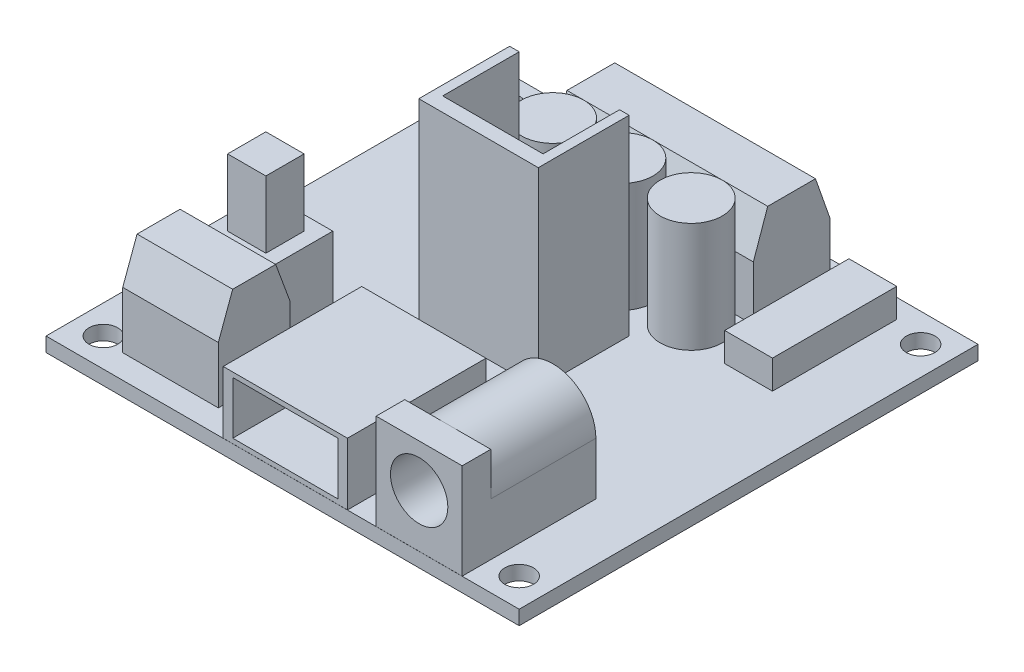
ISO-10303-21;
HEADER;
FILE_DESCRIPTION(('STEP AP214'),'2;1');
FILE_NAME('part.step','',(''),(''),'','','');
FILE_SCHEMA(('AUTOMOTIVE_DESIGN { 1 0 10303 214 1 1 1 1 }'));
ENDSEC;
DATA;
#1=APPLICATION_CONTEXT('core data for automotive mechanical design processes');
#2=APPLICATION_PROTOCOL_DEFINITION('international standard','automotive_design',2000,#1);
#3=PRODUCT_CONTEXT('',#1,'mechanical');
#4=PRODUCT('Part','Part','',(#3));
#5=PRODUCT_RELATED_PRODUCT_CATEGORY('part','',(#4));
#6=PRODUCT_DEFINITION_FORMATION('','',#4);
#7=PRODUCT_DEFINITION_CONTEXT('part definition',#1,'design');
#8=PRODUCT_DEFINITION('design','',#6,#7);
#9=PRODUCT_DEFINITION_SHAPE('','',#8);
#10=(LENGTH_UNIT() NAMED_UNIT(*) SI_UNIT(.MILLI.,.METRE.));
#11=(NAMED_UNIT(*) PLANE_ANGLE_UNIT() SI_UNIT($,.RADIAN.));
#12=(NAMED_UNIT(*) SI_UNIT($,.STERADIAN.) SOLID_ANGLE_UNIT());
#13=UNCERTAINTY_MEASURE_WITH_UNIT(LENGTH_MEASURE(1.E-05),#10,'distance_accuracy_value','');
#14=(GEOMETRIC_REPRESENTATION_CONTEXT(3) GLOBAL_UNCERTAINTY_ASSIGNED_CONTEXT((#13)) GLOBAL_UNIT_ASSIGNED_CONTEXT((#10,
#11,#12)) REPRESENTATION_CONTEXT('',''));
#15=CARTESIAN_POINT('',(0.,0.,0.));
#16=DIRECTION('',(0.,0.,1.));
#17=DIRECTION('',(1.,0.,0.));
#18=AXIS2_PLACEMENT_3D('',#15,#16,#17);
#19=CARTESIAN_POINT('',(28.1655194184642,13.,-30.3044430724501));
#20=DIRECTION('',(0.,-1.,0.));
#21=DIRECTION('',(0.,0.,-1.));
#22=AXIS2_PLACEMENT_3D('',#19,#20,#21);
#23=CYLINDRICAL_SURFACE('',#22,3.25);
#24=CARTESIAN_POINT('',(28.1655194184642,13.,-30.3044430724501));
#25=DIRECTION('',(0.,1.,0.));
#26=DIRECTION('',(0.,0.,1.));
#27=AXIS2_PLACEMENT_3D('',#24,#25,#26);
#28=CIRCLE('',#27,3.25);
#29=CARTESIAN_POINT('',(28.1655194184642,13.,-27.0544430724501));
#30=VERTEX_POINT('',#29);
#31=EDGE_CURVE('E11',#30,#30,#28,.T.);
#32=ORIENTED_EDGE('',*,*,#31,.F.);
#33=EDGE_LOOP('',(#32));
#34=FACE_BOUND('',#33,.T.);
#35=CARTESIAN_POINT('',(28.1655194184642,1.5,-30.3044430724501));
#36=DIRECTION('',(0.,1.,0.));
#37=DIRECTION('',(0.,0.,1.));
#38=AXIS2_PLACEMENT_3D('',#35,#36,#37);
#39=CIRCLE('',#38,3.25);
#40=CARTESIAN_POINT('',(28.1655194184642,1.5,-27.0544430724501));
#41=VERTEX_POINT('',#40);
#42=EDGE_CURVE('E46',#41,#41,#39,.T.);
#43=ORIENTED_EDGE('',*,*,#42,.T.);
#44=EDGE_LOOP('',(#43));
#45=FACE_BOUND('',#44,.T.);
#46=ADVANCED_FACE('F43',(#34,#45),#23,.T.);
#47=CARTESIAN_POINT('',(28.1655194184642,13.,-30.3044430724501));
#48=DIRECTION('',(0.,1.,0.));
#49=DIRECTION('',(0.,0.,1.));
#50=AXIS2_PLACEMENT_3D('',#47,#48,#49);
#51=PLANE('',#50);
#52=ORIENTED_EDGE('',*,*,#31,.T.);
#53=EDGE_LOOP('',(#52));
#54=FACE_BOUND('',#53,.T.);
#55=ADVANCED_FACE('F58',(#54),#51,.T.);
#56=CARTESIAN_POINT('',(28.1655194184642,1.5,-30.3044430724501));
#57=DIRECTION('',(0.,1.,0.));
#58=DIRECTION('',(0.,0.,1.));
#59=AXIS2_PLACEMENT_3D('',#56,#57,#58);
#60=PLANE('',#59);
#61=ORIENTED_EDGE('',*,*,#42,.F.);
#62=EDGE_LOOP('',(#61));
#63=FACE_BOUND('',#62,.T.);
#64=ADVANCED_FACE('F56',(#63),#60,.F.);
#65=CLOSED_SHELL('',(#46,#55,#64));
#66=MANIFOLD_SOLID_BREP('B2',#65);
#67=CARTESIAN_POINT('',(20.9155194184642,13.,-30.3044430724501));
#68=DIRECTION('',(0.,-1.,0.));
#69=DIRECTION('',(0.,0.,-1.));
#70=AXIS2_PLACEMENT_3D('',#67,#68,#69);
#71=CYLINDRICAL_SURFACE('',#70,3.25);
#72=CARTESIAN_POINT('',(20.9155194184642,13.,-30.3044430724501));
#73=DIRECTION('',(0.,1.,0.));
#74=DIRECTION('',(0.,0.,1.));
#75=AXIS2_PLACEMENT_3D('',#72,#73,#74);
#76=CIRCLE('',#75,3.25);
#77=CARTESIAN_POINT('',(20.9155194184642,13.,-27.0544430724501));
#78=VERTEX_POINT('',#77);
#79=EDGE_CURVE('E42',#78,#78,#76,.T.);
#80=ORIENTED_EDGE('',*,*,#79,.F.);
#81=EDGE_LOOP('',(#80));
#82=FACE_BOUND('',#81,.T.);
#83=CARTESIAN_POINT('',(20.9155194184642,1.5,-30.3044430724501));
#84=DIRECTION('',(0.,1.,0.));
#85=DIRECTION('',(0.,0.,1.));
#86=AXIS2_PLACEMENT_3D('',#83,#84,#85);
#87=CIRCLE('',#86,3.25);
#88=CARTESIAN_POINT('',(20.9155194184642,1.5,-27.0544430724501));
#89=VERTEX_POINT('',#88);
#90=EDGE_CURVE('E94',#89,#89,#87,.T.);
#91=ORIENTED_EDGE('',*,*,#90,.T.);
#92=EDGE_LOOP('',(#91));
#93=FACE_BOUND('',#92,.T.);
#94=ADVANCED_FACE('F91',(#82,#93),#71,.T.);
#95=CARTESIAN_POINT('',(20.9155194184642,13.,-30.3044430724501));
#96=DIRECTION('',(0.,1.,0.));
#97=DIRECTION('',(0.,0.,1.));
#98=AXIS2_PLACEMENT_3D('',#95,#96,#97);
#99=PLANE('',#98);
#100=ORIENTED_EDGE('',*,*,#79,.T.);
#101=EDGE_LOOP('',(#100));
#102=FACE_BOUND('',#101,.T.);
#103=ADVANCED_FACE('F106',(#102),#99,.T.);
#104=CARTESIAN_POINT('',(20.9155194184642,1.5,-30.3044430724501));
#105=DIRECTION('',(0.,1.,0.));
#106=DIRECTION('',(0.,0.,1.));
#107=AXIS2_PLACEMENT_3D('',#104,#105,#106);
#108=PLANE('',#107);
#109=ORIENTED_EDGE('',*,*,#90,.F.);
#110=EDGE_LOOP('',(#109));
#111=FACE_BOUND('',#110,.T.);
#112=ADVANCED_FACE('F104',(#111),#108,.F.);
#113=CLOSED_SHELL('',(#94,#103,#112));
#114=MANIFOLD_SOLID_BREP('B6',#113);
#115=CARTESIAN_POINT('',(13.6655194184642,13.,-30.3044430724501));
#116=DIRECTION('',(0.,-1.,0.));
#117=DIRECTION('',(0.,0.,-1.));
#118=AXIS2_PLACEMENT_3D('',#115,#116,#117);
#119=CYLINDRICAL_SURFACE('',#118,3.25);
#120=CARTESIAN_POINT('',(13.6655194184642,13.,-30.3044430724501));
#121=DIRECTION('',(0.,1.,0.));
#122=DIRECTION('',(0.,0.,1.));
#123=AXIS2_PLACEMENT_3D('',#120,#121,#122);
#124=CIRCLE('',#123,3.25);
#125=CARTESIAN_POINT('',(13.6655194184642,13.,-27.0544430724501));
#126=VERTEX_POINT('',#125);
#127=EDGE_CURVE('E90',#126,#126,#124,.T.);
#128=ORIENTED_EDGE('',*,*,#127,.F.);
#129=EDGE_LOOP('',(#128));
#130=FACE_BOUND('',#129,.T.);
#131=CARTESIAN_POINT('',(13.6655194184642,1.5,-30.3044430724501));
#132=DIRECTION('',(0.,1.,0.));
#133=DIRECTION('',(0.,0.,1.));
#134=AXIS2_PLACEMENT_3D('',#131,#132,#133);
#135=CIRCLE('',#134,3.25);
#136=CARTESIAN_POINT('',(13.6655194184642,1.5,-27.0544430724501));
#137=VERTEX_POINT('',#136);
#138=EDGE_CURVE('E143',#137,#137,#135,.T.);
#139=ORIENTED_EDGE('',*,*,#138,.T.);
#140=EDGE_LOOP('',(#139));
#141=FACE_BOUND('',#140,.T.);
#142=ADVANCED_FACE('F140',(#130,#141),#119,.T.);
#143=CARTESIAN_POINT('',(13.6655194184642,13.,-30.3044430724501));
#144=DIRECTION('',(0.,1.,0.));
#145=DIRECTION('',(0.,0.,1.));
#146=AXIS2_PLACEMENT_3D('',#143,#144,#145);
#147=PLANE('',#146);
#148=ORIENTED_EDGE('',*,*,#127,.T.);
#149=EDGE_LOOP('',(#148));
#150=FACE_BOUND('',#149,.T.);
#151=ADVANCED_FACE('F155',(#150),#147,.T.);
#152=CARTESIAN_POINT('',(13.6655194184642,1.5,-30.3044430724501));
#153=DIRECTION('',(0.,1.,0.));
#154=DIRECTION('',(0.,0.,1.));
#155=AXIS2_PLACEMENT_3D('',#152,#153,#154);
#156=PLANE('',#155);
#157=ORIENTED_EDGE('',*,*,#138,.F.);
#158=EDGE_LOOP('',(#157));
#159=FACE_BOUND('',#158,.T.);
#160=ADVANCED_FACE('F153',(#159),#156,.F.);
#161=CLOSED_SHELL('',(#142,#151,#160));
#162=MANIFOLD_SOLID_BREP('B37',#161);
#163=CARTESIAN_POINT('',(29.9427398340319,11.5,-9.55444433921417));
#164=DIRECTION('',(1.,0.,0.));
#165=DIRECTION('',(0.,0.,-1.));
#166=AXIS2_PLACEMENT_3D('',#163,#164,#165);
#167=PLANE('',#166);
#168=DIRECTION('',(0.,-1.,0.));
#169=VECTOR('',#168,1.);
#170=CARTESIAN_POINT('',(29.9427398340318,11.5,4.43555692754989));
#171=LINE('',#170,#169);
#172=CARTESIAN_POINT('',(29.9427398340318,11.5,4.43555692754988));
#173=VERTEX_POINT('',#172);
#174=CARTESIAN_POINT('',(29.9427398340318,1.5,4.43555692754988));
#175=VERTEX_POINT('',#174);
#176=EDGE_CURVE('E849',#173,#175,#171,.T.);
#177=ORIENTED_EDGE('',*,*,#176,.F.);
#178=DIRECTION('',(0.,0.,1.));
#179=VECTOR('',#178,1.);
#180=CARTESIAN_POINT('',(29.9427398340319,11.5,-9.55444433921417));
#181=LINE('',#180,#179);
#182=CARTESIAN_POINT('',(29.9427398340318,11.5,1.44555566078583));
#183=VERTEX_POINT('',#182);
#184=EDGE_CURVE('E839',#183,#173,#181,.T.);
#185=ORIENTED_EDGE('',*,*,#184,.F.);
#186=DIRECTION('',(0.,1.,0.));
#187=VECTOR('',#186,1.);
#188=CARTESIAN_POINT('',(29.9427398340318,11.5,1.44555566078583));
#189=LINE('',#188,#187);
#190=CARTESIAN_POINT('',(29.9427398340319,7.,1.44555566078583));
#191=VERTEX_POINT('',#190);
#192=EDGE_CURVE('E847',#191,#183,#189,.T.);
#193=ORIENTED_EDGE('',*,*,#192,.F.);
#194=DIRECTION('',(0.,0.,-1.));
#195=VECTOR('',#194,1.);
#196=CARTESIAN_POINT('',(29.9427398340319,7.,1.44555566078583));
#197=LINE('',#196,#195);
#198=CARTESIAN_POINT('',(29.9427398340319,7.,-9.55444433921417));
#199=VERTEX_POINT('',#198);
#200=EDGE_CURVE('E971',#191,#199,#197,.T.);
#201=ORIENTED_EDGE('',*,*,#200,.T.);
#202=DIRECTION('',(0.,-1.,0.));
#203=VECTOR('',#202,1.);
#204=CARTESIAN_POINT('',(29.9427398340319,11.5,-9.55444433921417));
#205=LINE('',#204,#203);
#206=CARTESIAN_POINT('',(29.9427398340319,1.5,-9.55444433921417));
#207=VERTEX_POINT('',#206);
#208=EDGE_CURVE('E850',#199,#207,#205,.T.);
#209=ORIENTED_EDGE('',*,*,#208,.T.);
#210=DIRECTION('',(0.,0.,1.));
#211=VECTOR('',#210,1.);
#212=CARTESIAN_POINT('',(29.9427398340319,1.5,-9.55444433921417));
#213=LINE('',#212,#211);
#214=EDGE_CURVE('E855',#207,#175,#213,.T.);
#215=ORIENTED_EDGE('',*,*,#214,.T.);
#216=EDGE_LOOP('',(#177,#185,#193,#201,#209,#215));
#217=FACE_BOUND('',#216,.T.);
#218=ADVANCED_FACE('F180',(#217),#167,.F.);
#219=CARTESIAN_POINT('',(0.,11.5,0.));
#220=DIRECTION('',(0.,1.,0.));
#221=DIRECTION('',(0.,0.,1.));
#222=AXIS2_PLACEMENT_3D('',#219,#220,#221);
#223=PLANE('',#222);
#224=ORIENTED_EDGE('',*,*,#184,.T.);
#225=DIRECTION('',(-1.,0.,0.));
#226=VECTOR('',#225,1.);
#227=CARTESIAN_POINT('',(38.9427398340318,11.5,4.43555692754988));
#228=LINE('',#227,#226);
#229=CARTESIAN_POINT('',(38.9427398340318,11.5,4.43555692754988));
#230=VERTEX_POINT('',#229);
#231=EDGE_CURVE('E945',#230,#173,#228,.T.);
#232=ORIENTED_EDGE('',*,*,#231,.F.);
#233=DIRECTION('',(0.,0.,-1.));
#234=VECTOR('',#233,1.);
#235=CARTESIAN_POINT('',(38.9427398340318,11.5,-9.55444433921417));
#236=LINE('',#235,#234);
#237=CARTESIAN_POINT('',(38.9427398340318,11.5,1.44555566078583));
#238=VERTEX_POINT('',#237);
#239=EDGE_CURVE('E851',#230,#238,#236,.T.);
#240=ORIENTED_EDGE('',*,*,#239,.T.);
#241=DIRECTION('',(-1.,0.,0.));
#242=VECTOR('',#241,1.);
#243=CARTESIAN_POINT('',(0.,11.5,1.44555566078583));
#244=LINE('',#243,#242);
#245=CARTESIAN_POINT('',(34.4427398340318,11.5,1.44555566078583));
#246=VERTEX_POINT('',#245);
#247=EDGE_CURVE('E138',#238,#246,#244,.T.);
#248=ORIENTED_EDGE('',*,*,#247,.T.);
#249=EDGE_CURVE('E189',#246,#183,#244,.T.);
#250=ORIENTED_EDGE('',*,*,#249,.T.);
#251=EDGE_LOOP('',(#224,#232,#240,#248,#250));
#252=FACE_BOUND('',#251,.T.);
#253=ADVANCED_FACE('F837',(#252),#223,.T.);
#254=CARTESIAN_POINT('',(26.9427398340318,8.,-10.0578376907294));
#255=DIRECTION('',(-1.,0.,0.));
#256=DIRECTION('',(0.,0.,1.));
#257=AXIS2_PLACEMENT_3D('',#254,#255,#256);
#258=PLANE('',#257);
#259=DIRECTION('',(0.,1.,0.));
#260=VECTOR('',#259,1.);
#261=CARTESIAN_POINT('',(26.9427398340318,8.,4.43555692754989));
#262=LINE('',#261,#260);
#263=CARTESIAN_POINT('',(26.9427398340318,1.5,4.43555692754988));
#264=VERTEX_POINT('',#263);
#265=CARTESIAN_POINT('',(26.9427398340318,8.,4.43555692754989));
#266=VERTEX_POINT('',#265);
#267=EDGE_CURVE('E958',#264,#266,#262,.T.);
#268=ORIENTED_EDGE('',*,*,#267,.F.);
#269=DIRECTION('',(0.,0.,-1.));
#270=VECTOR('',#269,1.);
#271=CARTESIAN_POINT('',(26.9427398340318,1.5,-10.0578376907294));
#272=LINE('',#271,#270);
#273=CARTESIAN_POINT('',(26.9427398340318,1.5,-10.0578376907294));
#274=VERTEX_POINT('',#273);
#275=EDGE_CURVE('E884',#264,#274,#272,.T.);
#276=ORIENTED_EDGE('',*,*,#275,.T.);
#277=DIRECTION('',(0.,-1.,0.));
#278=VECTOR('',#277,1.);
#279=CARTESIAN_POINT('',(26.9427398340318,8.,-10.0578376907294));
#280=LINE('',#279,#278);
#281=CARTESIAN_POINT('',(26.9427398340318,8.,-10.0578376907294));
#282=VERTEX_POINT('',#281);
#283=EDGE_CURVE('E910',#282,#274,#280,.T.);
#284=ORIENTED_EDGE('',*,*,#283,.F.);
#285=DIRECTION('',(0.,0.,-1.));
#286=VECTOR('',#285,1.);
#287=CARTESIAN_POINT('',(26.9427398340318,8.,-10.0578376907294));
#288=LINE('',#287,#286);
#289=EDGE_CURVE('E893',#266,#282,#288,.T.);
#290=ORIENTED_EDGE('',*,*,#289,.F.);
#291=EDGE_LOOP('',(#268,#276,#284,#290));
#292=FACE_BOUND('',#291,.T.);
#293=ADVANCED_FACE('F1019',(#292),#258,.F.);
#294=CARTESIAN_POINT('',(13.9427398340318,8.,-10.0578376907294));
#295=DIRECTION('',(1.,0.,0.));
#296=DIRECTION('',(0.,0.,-1.));
#297=AXIS2_PLACEMENT_3D('',#294,#295,#296);
#298=PLANE('',#297);
#299=DIRECTION('',(0.,-1.,0.));
#300=VECTOR('',#299,1.);
#301=CARTESIAN_POINT('',(13.9427398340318,11.5,4.43555692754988));
#302=LINE('',#301,#300);
#303=CARTESIAN_POINT('',(13.9427398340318,8.,4.43555692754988));
#304=VERTEX_POINT('',#303);
#305=CARTESIAN_POINT('',(13.9427398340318,1.5,4.43555692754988));
#306=VERTEX_POINT('',#305);
#307=EDGE_CURVE('E934',#304,#306,#302,.T.);
#308=ORIENTED_EDGE('',*,*,#307,.F.);
#309=DIRECTION('',(0.,0.,1.));
#310=VECTOR('',#309,1.);
#311=CARTESIAN_POINT('',(13.9427398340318,8.,-10.0578376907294));
#312=LINE('',#311,#310);
#313=CARTESIAN_POINT('',(13.9427398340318,8.,-10.0578376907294));
#314=VERTEX_POINT('',#313);
#315=EDGE_CURVE('E898',#314,#304,#312,.T.);
#316=ORIENTED_EDGE('',*,*,#315,.F.);
#317=DIRECTION('',(0.,-1.,0.));
#318=VECTOR('',#317,1.);
#319=CARTESIAN_POINT('',(13.9427398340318,8.,-10.0578376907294));
#320=LINE('',#319,#318);
#321=CARTESIAN_POINT('',(13.9427398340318,1.5,-10.0578376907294));
#322=VERTEX_POINT('',#321);
#323=EDGE_CURVE('E901',#314,#322,#320,.T.);
#324=ORIENTED_EDGE('',*,*,#323,.T.);
#325=DIRECTION('',(0.,0.,1.));
#326=VECTOR('',#325,1.);
#327=CARTESIAN_POINT('',(13.9427398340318,1.5,-10.0578376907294));
#328=LINE('',#327,#326);
#329=EDGE_CURVE('E896',#322,#306,#328,.T.);
#330=ORIENTED_EDGE('',*,*,#329,.T.);
#331=EDGE_LOOP('',(#308,#316,#324,#330));
#332=FACE_BOUND('',#331,.T.);
#333=ADVANCED_FACE('F1052',(#332),#298,.F.);
#334=CARTESIAN_POINT('',(0.,8.,0.));
#335=DIRECTION('',(0.,1.,0.));
#336=DIRECTION('',(0.,0.,1.));
#337=AXIS2_PLACEMENT_3D('',#334,#335,#336);
#338=PLANE('',#337);
#339=ORIENTED_EDGE('',*,*,#315,.T.);
#340=DIRECTION('',(1.,0.,0.));
#341=VECTOR('',#340,1.);
#342=CARTESIAN_POINT('',(0.,8.,4.43555692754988));
#343=LINE('',#342,#341);
#344=EDGE_CURVE('E955',#304,#266,#343,.T.);
#345=ORIENTED_EDGE('',*,*,#344,.T.);
#346=ORIENTED_EDGE('',*,*,#289,.T.);
#347=DIRECTION('',(-1.,0.,0.));
#348=VECTOR('',#347,1.);
#349=CARTESIAN_POINT('',(13.9427398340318,8.,-10.0578376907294));
#350=LINE('',#349,#348);
#351=EDGE_CURVE('E895',#282,#314,#350,.T.);
#352=ORIENTED_EDGE('',*,*,#351,.T.);
#353=EDGE_LOOP('',(#339,#345,#346,#352));
#354=FACE_BOUND('',#353,.T.);
#355=ADVANCED_FACE('F1028',(#354),#338,.T.);
#356=CARTESIAN_POINT('',(38.9427398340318,11.5,-9.55444433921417));
#357=DIRECTION('',(-1.,0.,0.));
#358=DIRECTION('',(0.,0.,1.));
#359=AXIS2_PLACEMENT_3D('',#356,#357,#358);
#360=PLANE('',#359);
#361=DIRECTION('',(0.,1.,0.));
#362=VECTOR('',#361,1.);
#363=CARTESIAN_POINT('',(38.9427398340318,1.5,4.43555692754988));
#364=LINE('',#363,#362);
#365=CARTESIAN_POINT('',(38.9427398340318,1.5,4.43555692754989));
#366=VERTEX_POINT('',#365);
#367=EDGE_CURVE('E943',#366,#230,#364,.T.);
#368=ORIENTED_EDGE('',*,*,#367,.F.);
#369=DIRECTION('',(0.,0.,-1.));
#370=VECTOR('',#369,1.);
#371=CARTESIAN_POINT('',(38.9427398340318,1.5,-9.55444433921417));
#372=LINE('',#371,#370);
#373=CARTESIAN_POINT('',(38.9427398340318,1.5,-9.55444433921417));
#374=VERTEX_POINT('',#373);
#375=EDGE_CURVE('E859',#366,#374,#372,.T.);
#376=ORIENTED_EDGE('',*,*,#375,.T.);
#377=DIRECTION('',(0.,-1.,0.));
#378=VECTOR('',#377,1.);
#379=CARTESIAN_POINT('',(38.9427398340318,11.5,-9.55444433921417));
#380=LINE('',#379,#378);
#381=CARTESIAN_POINT('',(38.9427398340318,7.,-9.55444433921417));
#382=VERTEX_POINT('',#381);
#383=EDGE_CURVE('E853',#382,#374,#380,.T.);
#384=ORIENTED_EDGE('',*,*,#383,.F.);
#385=DIRECTION('',(0.,0.,-1.));
#386=VECTOR('',#385,1.);
#387=CARTESIAN_POINT('',(38.9427398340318,7.,1.44555566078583));
#388=LINE('',#387,#386);
#389=CARTESIAN_POINT('',(38.9427398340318,7.,1.44555566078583));
#390=VERTEX_POINT('',#389);
#391=EDGE_CURVE('E968',#390,#382,#388,.T.);
#392=ORIENTED_EDGE('',*,*,#391,.F.);
#393=DIRECTION('',(0.,-1.,0.));
#394=VECTOR('',#393,1.);
#395=CARTESIAN_POINT('',(38.9427398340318,11.5,1.44555566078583));
#396=LINE('',#395,#394);
#397=EDGE_CURVE('E862',#238,#390,#396,.T.);
#398=ORIENTED_EDGE('',*,*,#397,.F.);
#399=ORIENTED_EDGE('',*,*,#239,.F.);
#400=EDGE_LOOP('',(#368,#376,#384,#392,#398,#399));
#401=FACE_BOUND('',#400,.T.);
#402=ADVANCED_FACE('F987',(#401),#360,.F.);
#403=CARTESIAN_POINT('',(0.,1.5,0.));
#404=DIRECTION('',(0.,1.,0.));
#405=DIRECTION('',(0.,0.,1.));
#406=AXIS2_PLACEMENT_3D('',#403,#404,#405);
#407=PLANE('',#406);
#408=DIRECTION('',(1.,0.,0.));
#409=VECTOR('',#408,1.);
#410=CARTESIAN_POINT('',(13.9427398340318,1.5,4.43555692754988));
#411=LINE('',#410,#409);
#412=EDGE_CURVE('E940',#175,#366,#411,.T.);
#413=ORIENTED_EDGE('',*,*,#412,.F.);
#414=ORIENTED_EDGE('',*,*,#214,.F.);
#415=DIRECTION('',(-1.,0.,0.));
#416=VECTOR('',#415,1.);
#417=CARTESIAN_POINT('',(29.9427398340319,1.5,-9.55444433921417));
#418=LINE('',#417,#416);
#419=EDGE_CURVE('E861',#374,#207,#418,.T.);
#420=ORIENTED_EDGE('',*,*,#419,.F.);
#421=ORIENTED_EDGE('',*,*,#375,.F.);
#422=EDGE_LOOP('',(#413,#414,#420,#421));
#423=FACE_BOUND('',#422,.T.);
#424=DIRECTION('',(1.,0.,0.));
#425=VECTOR('',#424,1.);
#426=CARTESIAN_POINT('',(-4.58448058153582,1.5,4.44555692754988));
#427=LINE('',#426,#425);
#428=CARTESIAN_POINT('',(-4.58448058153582,1.5,4.44555692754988));
#429=VERTEX_POINT('',#428);
#430=CARTESIAN_POINT('',(44.9155194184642,1.5,4.44555692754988));
#431=VERTEX_POINT('',#430);
#432=EDGE_CURVE('E809',#429,#431,#427,.T.);
#433=ORIENTED_EDGE('',*,*,#432,.T.);
#434=DIRECTION('',(0.,0.,-1.));
#435=VECTOR('',#434,1.);
#436=CARTESIAN_POINT('',(44.9155194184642,1.5,-43.5544430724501));
#437=LINE('',#436,#435);
#438=CARTESIAN_POINT('',(44.9155194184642,1.5,-43.5544430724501));
#439=VERTEX_POINT('',#438);
#440=EDGE_CURVE('E801',#431,#439,#437,.T.);
#441=ORIENTED_EDGE('',*,*,#440,.T.);
#442=DIRECTION('',(-1.,0.,0.));
#443=VECTOR('',#442,1.);
#444=CARTESIAN_POINT('',(-4.58448058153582,1.5,-43.5544430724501));
#445=LINE('',#444,#443);
#446=CARTESIAN_POINT('',(-4.58448058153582,1.5,-43.5544430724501));
#447=VERTEX_POINT('',#446);
#448=EDGE_CURVE('E804',#439,#447,#445,.T.);
#449=ORIENTED_EDGE('',*,*,#448,.T.);
#450=DIRECTION('',(0.,0.,1.));
#451=VECTOR('',#450,1.);
#452=CARTESIAN_POINT('',(-4.58448058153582,1.5,-43.5544430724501));
#453=LINE('',#452,#451);
#454=EDGE_CURVE('E807',#447,#429,#453,.T.);
#455=ORIENTED_EDGE('',*,*,#454,.T.);
#456=EDGE_LOOP('',(#433,#441,#449,#455));
#457=FACE_BOUND('',#456,.T.);
#458=ORIENTED_EDGE('',*,*,#275,.F.);
#459=EDGE_CURVE('E941',#306,#264,#411,.T.);
#460=ORIENTED_EDGE('',*,*,#459,.F.);
#461=ORIENTED_EDGE('',*,*,#329,.F.);
#462=DIRECTION('',(-1.,0.,0.));
#463=VECTOR('',#462,1.);
#464=CARTESIAN_POINT('',(13.9427398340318,1.5,-10.0578376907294));
#465=LINE('',#464,#463);
#466=EDGE_CURVE('E903',#274,#322,#465,.T.);
#467=ORIENTED_EDGE('',*,*,#466,.F.);
#468=EDGE_LOOP('',(#458,#460,#461,#467));
#469=FACE_BOUND('',#468,.T.);
#470=DIRECTION('',(-1.,0.,0.));
#471=VECTOR('',#470,1.);
#472=CARTESIAN_POINT('',(0.942739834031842,1.5,-5.55444307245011));
#473=LINE('',#472,#471);
#474=CARTESIAN_POINT('',(10.9427398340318,1.5,-5.55444307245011));
#475=VERTEX_POINT('',#474);
#476=CARTESIAN_POINT('',(0.942739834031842,1.5,-5.55444307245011));
#477=VERTEX_POINT('',#476);
#478=EDGE_CURVE('E916',#475,#477,#473,.T.);
#479=ORIENTED_EDGE('',*,*,#478,.F.);
#480=DIRECTION('',(0.,0.,-1.));
#481=VECTOR('',#480,1.);
#482=CARTESIAN_POINT('',(10.9427398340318,1.5,-5.55444307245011));
#483=LINE('',#482,#481);
#484=CARTESIAN_POINT('',(10.9427398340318,1.5,1.94555692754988));
#485=VERTEX_POINT('',#484);
#486=EDGE_CURVE('E913',#485,#475,#483,.T.);
#487=ORIENTED_EDGE('',*,*,#486,.F.);
#488=DIRECTION('',(1.,0.,0.));
#489=VECTOR('',#488,1.);
#490=CARTESIAN_POINT('',(0.942739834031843,1.5,1.94555692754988));
#491=LINE('',#490,#489);
#492=CARTESIAN_POINT('',(0.942739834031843,1.5,1.94555692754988));
#493=VERTEX_POINT('',#492);
#494=EDGE_CURVE('E547',#493,#485,#491,.T.);
#495=ORIENTED_EDGE('',*,*,#494,.F.);
#496=DIRECTION('',(0.,0.,1.));
#497=VECTOR('',#496,1.);
#498=CARTESIAN_POINT('',(0.942739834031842,1.5,-5.55444307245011));
#499=LINE('',#498,#497);
#500=EDGE_CURVE('E918',#477,#493,#499,.T.);
#501=ORIENTED_EDGE('',*,*,#500,.F.);
#502=EDGE_LOOP('',(#479,#487,#495,#501));
#503=FACE_BOUND('',#502,.T.);
#504=DIRECTION('',(-1.,0.,0.));
#505=VECTOR('',#504,1.);
#506=CARTESIAN_POINT('',(24.9155194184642,1.5,-26.0544430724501));
#507=LINE('',#506,#505);
#508=CARTESIAN_POINT('',(25.9155194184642,1.5,-26.0544430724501));
#509=VERTEX_POINT('',#508);
#510=CARTESIAN_POINT('',(24.9155194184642,1.5,-26.0544430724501));
#511=VERTEX_POINT('',#510);
#512=EDGE_CURVE('E642',#509,#511,#507,.T.);
#513=ORIENTED_EDGE('',*,*,#512,.F.);
#514=DIRECTION('',(0.,0.,-1.));
#515=VECTOR('',#514,1.);
#516=CARTESIAN_POINT('',(25.9155194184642,1.5,-26.0544430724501));
#517=LINE('',#516,#515);
#518=CARTESIAN_POINT('',(25.9155194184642,1.5,-16.5544430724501));
#519=VERTEX_POINT('',#518);
#520=EDGE_CURVE('E620',#519,#509,#517,.T.);
#521=ORIENTED_EDGE('',*,*,#520,.F.);
#522=DIRECTION('',(1.,0.,0.));
#523=VECTOR('',#522,1.);
#524=CARTESIAN_POINT('',(13.4155194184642,1.5,-16.5544430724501));
#525=LINE('',#524,#523);
#526=CARTESIAN_POINT('',(13.4155194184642,1.5,-16.5544430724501));
#527=VERTEX_POINT('',#526);
#528=EDGE_CURVE('E625',#527,#519,#525,.T.);
#529=ORIENTED_EDGE('',*,*,#528,.F.);
#530=DIRECTION('',(0.,0.,1.));
#531=VECTOR('',#530,1.);
#532=CARTESIAN_POINT('',(13.4155194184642,1.5,-26.0544430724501));
#533=LINE('',#532,#531);
#534=CARTESIAN_POINT('',(13.4155194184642,1.5,-26.0544430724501));
#535=VERTEX_POINT('',#534);
#536=EDGE_CURVE('E652',#535,#527,#533,.T.);
#537=ORIENTED_EDGE('',*,*,#536,.F.);
#538=DIRECTION('',(-1.,0.,0.));
#539=VECTOR('',#538,1.);
#540=CARTESIAN_POINT('',(13.4155194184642,1.5,-26.0544430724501));
#541=LINE('',#540,#539);
#542=CARTESIAN_POINT('',(14.4155194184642,1.5,-26.0544430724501));
#543=VERTEX_POINT('',#542);
#544=EDGE_CURVE('E650',#543,#535,#541,.T.);
#545=ORIENTED_EDGE('',*,*,#544,.F.);
#546=DIRECTION('',(0.,0.,-1.));
#547=VECTOR('',#546,1.);
#548=CARTESIAN_POINT('',(14.4155194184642,1.5,-26.0544430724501));
#549=LINE('',#548,#547);
#550=CARTESIAN_POINT('',(14.4155194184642,1.5,-18.0544430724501));
#551=VERTEX_POINT('',#550);
#552=EDGE_CURVE('E648',#551,#543,#549,.T.);
#553=ORIENTED_EDGE('',*,*,#552,.F.);
#554=DIRECTION('',(-1.,0.,0.));
#555=VECTOR('',#554,1.);
#556=CARTESIAN_POINT('',(14.4155194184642,1.5,-18.0544430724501));
#557=LINE('',#556,#555);
#558=CARTESIAN_POINT('',(24.9155194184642,1.5,-18.0544430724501));
#559=VERTEX_POINT('',#558);
#560=EDGE_CURVE('E646',#559,#551,#557,.T.);
#561=ORIENTED_EDGE('',*,*,#560,.F.);
#562=DIRECTION('',(0.,0.,1.));
#563=VECTOR('',#562,1.);
#564=CARTESIAN_POINT('',(24.9155194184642,1.5,-18.0544430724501));
#565=LINE('',#564,#563);
#566=EDGE_CURVE('E644',#511,#559,#565,.T.);
#567=ORIENTED_EDGE('',*,*,#566,.F.);
#568=EDGE_LOOP('',(#513,#521,#529,#537,#545,#553,#561,#567));
#569=FACE_BOUND('',#568,.T.);
#570=DIRECTION('',(-1.,0.,0.));
#571=VECTOR('',#570,1.);
#572=CARTESIAN_POINT('',(33.4155194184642,1.5,-41.5544430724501));
#573=LINE('',#572,#571);
#574=CARTESIAN_POINT('',(38.4155194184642,1.5,-41.5544430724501));
#575=VERTEX_POINT('',#574);
#576=CARTESIAN_POINT('',(33.4155194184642,1.5,-41.5544430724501));
#577=VERTEX_POINT('',#576);
#578=EDGE_CURVE('E720',#575,#577,#573,.T.);
#579=ORIENTED_EDGE('',*,*,#578,.F.);
#580=DIRECTION('',(0.,0.,-1.));
#581=VECTOR('',#580,1.);
#582=CARTESIAN_POINT('',(38.4155194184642,1.5,-41.5544430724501));
#583=LINE('',#582,#581);
#584=CARTESIAN_POINT('',(38.4155194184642,1.5,-28.5544430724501));
#585=VERTEX_POINT('',#584);
#586=EDGE_CURVE('E706',#585,#575,#583,.T.);
#587=ORIENTED_EDGE('',*,*,#586,.F.);
#588=DIRECTION('',(1.,0.,0.));
#589=VECTOR('',#588,1.);
#590=CARTESIAN_POINT('',(33.4155194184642,1.5,-28.5544430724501));
#591=LINE('',#590,#589);
#592=CARTESIAN_POINT('',(33.4155194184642,1.5,-28.5544430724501));
#593=VERTEX_POINT('',#592);
#594=EDGE_CURVE('E711',#593,#585,#591,.T.);
#595=ORIENTED_EDGE('',*,*,#594,.F.);
#596=DIRECTION('',(0.,0.,1.));
#597=VECTOR('',#596,1.);
#598=CARTESIAN_POINT('',(33.4155194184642,1.5,-41.5544430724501));
#599=LINE('',#598,#597);
#600=EDGE_CURVE('E722',#577,#593,#599,.T.);
#601=ORIENTED_EDGE('',*,*,#600,.F.);
#602=EDGE_LOOP('',(#579,#587,#595,#601));
#603=FACE_BOUND('',#602,.T.);
#604=CARTESIAN_POINT('',(41.9155194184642,1.5,-40.5544430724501));
#605=DIRECTION('',(0.,1.,0.));
#606=DIRECTION('',(0.,0.,1.));
#607=AXIS2_PLACEMENT_3D('',#604,#605,#606);
#608=CIRCLE('',#607,1.5);
#609=CARTESIAN_POINT('',(41.9155194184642,1.5,-39.0544430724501));
#610=VERTEX_POINT('',#609);
#611=EDGE_CURVE('E777',#610,#610,#608,.T.);
#612=ORIENTED_EDGE('',*,*,#611,.F.);
#613=EDGE_LOOP('',(#612));
#614=FACE_BOUND('',#613,.T.);
#615=CARTESIAN_POINT('',(-1.58448058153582,1.5,-40.5544430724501));
#616=DIRECTION('',(0.,1.,0.));
#617=DIRECTION('',(0.,0.,-1.));
#618=AXIS2_PLACEMENT_3D('',#615,#616,#617);
#619=CIRCLE('',#618,1.5);
#620=CARTESIAN_POINT('',(-1.58448058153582,1.5,-42.0544430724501));
#621=VERTEX_POINT('',#620);
#622=EDGE_CURVE('E789',#621,#621,#619,.T.);
#623=ORIENTED_EDGE('',*,*,#622,.F.);
#624=EDGE_LOOP('',(#623));
#625=FACE_BOUND('',#624,.T.);
#626=CARTESIAN_POINT('',(-1.58448058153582,1.5,1.44555692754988));
#627=DIRECTION('',(0.,1.,0.));
#628=DIRECTION('',(0.,0.,1.));
#629=AXIS2_PLACEMENT_3D('',#626,#627,#628);
#630=CIRCLE('',#629,1.5);
#631=CARTESIAN_POINT('',(-1.58448058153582,1.5,2.94555692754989));
#632=VERTEX_POINT('',#631);
#633=EDGE_CURVE('E795',#632,#632,#630,.T.);
#634=ORIENTED_EDGE('',*,*,#633,.F.);
#635=EDGE_LOOP('',(#634));
#636=FACE_BOUND('',#635,.T.);
#637=CARTESIAN_POINT('',(41.9155194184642,1.5,1.44555692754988));
#638=DIRECTION('',(0.,1.,0.));
#639=DIRECTION('',(0.,0.,-1.));
#640=AXIS2_PLACEMENT_3D('',#637,#638,#639);
#641=CIRCLE('',#640,1.5);
#642=CARTESIAN_POINT('',(41.9155194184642,1.5,-0.0544430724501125));
#643=VERTEX_POINT('',#642);
#644=EDGE_CURVE('E783',#643,#643,#641,.T.);
#645=ORIENTED_EDGE('',*,*,#644,.F.);
#646=EDGE_LOOP('',(#645));
#647=FACE_BOUND('',#646,.T.);
#648=DIRECTION('',(-1.,0.,0.));
#649=VECTOR('',#648,1.);
#650=CARTESIAN_POINT('',(10.4155194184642,1.5,-41.5544430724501));
#651=LINE('',#650,#649);
#652=CARTESIAN_POINT('',(31.4155194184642,1.5,-41.5544430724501));
#653=VERTEX_POINT('',#652);
#654=CARTESIAN_POINT('',(10.4155194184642,1.5,-41.5544430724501));
#655=VERTEX_POINT('',#654);
#656=EDGE_CURVE('E761',#653,#655,#651,.T.);
#657=ORIENTED_EDGE('',*,*,#656,.F.);
#658=DIRECTION('',(0.,0.,-1.));
#659=VECTOR('',#658,1.);
#660=CARTESIAN_POINT('',(31.4155194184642,1.5,-41.5544430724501));
#661=LINE('',#660,#659);
#662=CARTESIAN_POINT('',(31.4155194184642,1.5,-33.5544430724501));
#663=VERTEX_POINT('',#662);
#664=EDGE_CURVE('E750',#663,#653,#661,.T.);
#665=ORIENTED_EDGE('',*,*,#664,.F.);
#666=DIRECTION('',(1.,0.,0.));
#667=VECTOR('',#666,1.);
#668=CARTESIAN_POINT('',(10.4155194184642,1.5,-33.5544430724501));
#669=LINE('',#668,#667);
#670=CARTESIAN_POINT('',(10.4155194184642,1.5,-33.5544430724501));
#671=VERTEX_POINT('',#670);
#672=EDGE_CURVE('E755',#671,#663,#669,.T.);
#673=ORIENTED_EDGE('',*,*,#672,.F.);
#674=DIRECTION('',(0.,0.,1.));
#675=VECTOR('',#674,1.);
#676=CARTESIAN_POINT('',(10.4155194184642,1.5,-41.5544430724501));
#677=LINE('',#676,#675);
#678=EDGE_CURVE('E764',#655,#671,#677,.T.);
#679=ORIENTED_EDGE('',*,*,#678,.F.);
#680=EDGE_LOOP('',(#657,#665,#673,#679));
#681=FACE_BOUND('',#680,.T.);
#682=DIRECTION('',(-1.,0.,0.));
#683=VECTOR('',#682,1.);
#684=CARTESIAN_POINT('',(8.4155194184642,1.5,-41.5544430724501));
#685=LINE('',#684,#683);
#686=CARTESIAN_POINT('',(8.4155194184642,1.5,-41.5544430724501));
#687=VERTEX_POINT('',#686);
#688=CARTESIAN_POINT('',(3.4155194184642,1.5,-41.5544430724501));
#689=VERTEX_POINT('',#688);
#690=EDGE_CURVE('E691',#687,#689,#685,.T.);
#691=ORIENTED_EDGE('',*,*,#690,.F.);
#692=DIRECTION('',(0.,0.,-1.));
#693=VECTOR('',#692,1.);
#694=CARTESIAN_POINT('',(8.4155194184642,1.5,-41.5544430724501));
#695=LINE('',#694,#693);
#696=CARTESIAN_POINT('',(8.4155194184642,1.5,-28.5544430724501));
#697=VERTEX_POINT('',#696);
#698=EDGE_CURVE('E677',#697,#687,#695,.T.);
#699=ORIENTED_EDGE('',*,*,#698,.F.);
#700=DIRECTION('',(1.,0.,0.));
#701=VECTOR('',#700,1.);
#702=CARTESIAN_POINT('',(8.4155194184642,1.5,-28.5544430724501));
#703=LINE('',#702,#701);
#704=CARTESIAN_POINT('',(3.41551941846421,1.5,-28.5544430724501));
#705=VERTEX_POINT('',#704);
#706=EDGE_CURVE('E682',#705,#697,#703,.T.);
#707=ORIENTED_EDGE('',*,*,#706,.F.);
#708=DIRECTION('',(0.,0.,1.));
#709=VECTOR('',#708,1.);
#710=CARTESIAN_POINT('',(3.4155194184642,1.5,-41.5544430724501));
#711=LINE('',#710,#709);
#712=EDGE_CURVE('E693',#689,#705,#711,.T.);
#713=ORIENTED_EDGE('',*,*,#712,.F.);
#714=EDGE_LOOP('',(#691,#699,#707,#713));
#715=FACE_BOUND('',#714,.T.);
#716=DIRECTION('',(-1.,0.,0.));
#717=VECTOR('',#716,1.);
#718=CARTESIAN_POINT('',(0.915519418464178,1.5,-13.0544430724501));
#719=LINE('',#718,#717);
#720=CARTESIAN_POINT('',(7.91551941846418,1.5,-13.0544430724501));
#721=VERTEX_POINT('',#720);
#722=CARTESIAN_POINT('',(0.915519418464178,1.5,-13.0544430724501));
#723=VERTEX_POINT('',#722);
#724=EDGE_CURVE('E605',#721,#723,#719,.T.);
#725=ORIENTED_EDGE('',*,*,#724,.F.);
#726=DIRECTION('',(0.,0.,-1.));
#727=VECTOR('',#726,1.);
#728=CARTESIAN_POINT('',(7.91551941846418,1.5,-13.0544430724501));
#729=LINE('',#728,#727);
#730=CARTESIAN_POINT('',(7.91551941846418,1.5,-6.05444307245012));
#731=VERTEX_POINT('',#730);
#732=EDGE_CURVE('E591',#731,#721,#729,.T.);
#733=ORIENTED_EDGE('',*,*,#732,.F.);
#734=DIRECTION('',(1.,0.,0.));
#735=VECTOR('',#734,1.);
#736=CARTESIAN_POINT('',(0.915519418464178,1.5,-6.05444307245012));
#737=LINE('',#736,#735);
#738=CARTESIAN_POINT('',(0.915519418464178,1.5,-6.05444307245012));
#739=VERTEX_POINT('',#738);
#740=EDGE_CURVE('E596',#739,#731,#737,.T.);
#741=ORIENTED_EDGE('',*,*,#740,.F.);
#742=DIRECTION('',(0.,0.,1.));
#743=VECTOR('',#742,1.);
#744=CARTESIAN_POINT('',(0.915519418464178,1.5,-13.0544430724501));
#745=LINE('',#744,#743);
#746=EDGE_CURVE('E607',#723,#739,#745,.T.);
#747=ORIENTED_EDGE('',*,*,#746,.F.);
#748=EDGE_LOOP('',(#725,#733,#741,#747));
#749=FACE_BOUND('',#748,.T.);
#750=ADVANCED_FACE('F927',(#423,#457,#469,#503,#569,#603,#614,#625,#636,#647,#681,#715,#749),
#407,.T.);
#751=CARTESIAN_POINT('',(0.,8.5,0.));
#752=DIRECTION('',(0.,1.,0.));
#753=DIRECTION('',(0.,0.,1.));
#754=AXIS2_PLACEMENT_3D('',#751,#752,#753);
#755=PLANE('',#754);
#756=DIRECTION('',(0.,0.,-1.));
#757=VECTOR('',#756,1.);
#758=CARTESIAN_POINT('',(7.91551941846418,8.5,-13.0544430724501));
#759=LINE('',#758,#757);
#760=CARTESIAN_POINT('',(7.91551941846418,8.5,-6.05444307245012));
#761=VERTEX_POINT('',#760);
#762=CARTESIAN_POINT('',(7.91551941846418,8.5,-13.0544430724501));
#763=VERTEX_POINT('',#762);
#764=EDGE_CURVE('E592',#761,#763,#759,.T.);
#765=ORIENTED_EDGE('',*,*,#764,.T.);
#766=DIRECTION('',(-1.,0.,0.));
#767=VECTOR('',#766,1.);
#768=CARTESIAN_POINT('',(0.915519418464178,8.5,-13.0544430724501));
#769=LINE('',#768,#767);
#770=CARTESIAN_POINT('',(0.915519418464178,8.5,-13.0544430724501));
#771=VERTEX_POINT('',#770);
#772=EDGE_CURVE('E595',#763,#771,#769,.T.);
#773=ORIENTED_EDGE('',*,*,#772,.T.);
#774=DIRECTION('',(0.,0.,1.));
#775=VECTOR('',#774,1.);
#776=CARTESIAN_POINT('',(0.915519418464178,8.5,-13.0544430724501));
#777=LINE('',#776,#775);
#778=CARTESIAN_POINT('',(0.915519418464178,8.5,-6.05444307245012));
#779=VERTEX_POINT('',#778);
#780=EDGE_CURVE('E598',#771,#779,#777,.T.);
#781=ORIENTED_EDGE('',*,*,#780,.T.);
#782=DIRECTION('',(1.,0.,0.));
#783=VECTOR('',#782,1.);
#784=CARTESIAN_POINT('',(0.915519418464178,8.5,-6.05444307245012));
#785=LINE('',#784,#783);
#786=EDGE_CURVE('E600',#779,#761,#785,.T.);
#787=ORIENTED_EDGE('',*,*,#786,.T.);
#788=EDGE_LOOP('',(#765,#773,#781,#787));
#789=FACE_BOUND('',#788,.T.);
#790=DIRECTION('',(-1.,0.,0.));
#791=VECTOR('',#790,1.);
#792=CARTESIAN_POINT('',(2.41551941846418,8.5,-11.5544430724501));
#793=LINE('',#792,#791);
#794=CARTESIAN_POINT('',(6.41551941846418,8.5,-11.5544430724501));
#795=VERTEX_POINT('',#794);
#796=CARTESIAN_POINT('',(2.41551941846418,8.5,-11.5544430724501));
#797=VERTEX_POINT('',#796);
#798=EDGE_CURVE('E576',#795,#797,#793,.T.);
#799=ORIENTED_EDGE('',*,*,#798,.F.);
#800=DIRECTION('',(0.,0.,-1.));
#801=VECTOR('',#800,1.);
#802=CARTESIAN_POINT('',(6.41551941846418,8.5,-11.5544430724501));
#803=LINE('',#802,#801);
#804=CARTESIAN_POINT('',(6.41551941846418,8.5,-7.55444307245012));
#805=VERTEX_POINT('',#804);
#806=EDGE_CURVE('E562',#805,#795,#803,.T.);
#807=ORIENTED_EDGE('',*,*,#806,.F.);
#808=DIRECTION('',(1.,0.,0.));
#809=VECTOR('',#808,1.);
#810=CARTESIAN_POINT('',(2.41551941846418,8.5,-7.55444307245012));
#811=LINE('',#810,#809);
#812=CARTESIAN_POINT('',(2.41551941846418,8.5,-7.55444307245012));
#813=VERTEX_POINT('',#812);
#814=EDGE_CURVE('E567',#813,#805,#811,.T.);
#815=ORIENTED_EDGE('',*,*,#814,.F.);
#816=DIRECTION('',(0.,0.,1.));
#817=VECTOR('',#816,1.);
#818=CARTESIAN_POINT('',(2.41551941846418,8.5,-11.5544430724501));
#819=LINE('',#818,#817);
#820=EDGE_CURVE('E578',#797,#813,#819,.T.);
#821=ORIENTED_EDGE('',*,*,#820,.F.);
#822=EDGE_LOOP('',(#799,#807,#815,#821));
#823=FACE_BOUND('',#822,.T.);
#824=ADVANCED_FACE('F1096',(#789,#823),#755,.T.);
#825=CARTESIAN_POINT('',(0.,0.,0.));
#826=DIRECTION('',(0.,1.,0.));
#827=DIRECTION('',(0.,0.,1.));
#828=AXIS2_PLACEMENT_3D('',#825,#826,#827);
#829=PLANE('',#828);
#830=CARTESIAN_POINT('',(41.9155194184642,0.,1.44555692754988));
#831=DIRECTION('',(0.,1.,0.));
#832=DIRECTION('',(0.,0.,-1.));
#833=AXIS2_PLACEMENT_3D('',#830,#831,#832);
#834=CIRCLE('',#833,1.5);
#835=CARTESIAN_POINT('',(41.9155194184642,0.,-0.0544430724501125));
#836=VERTEX_POINT('',#835);
#837=EDGE_CURVE('E780',#836,#836,#834,.T.);
#838=ORIENTED_EDGE('',*,*,#837,.T.);
#839=EDGE_LOOP('',(#838));
#840=FACE_BOUND('',#839,.T.);
#841=CARTESIAN_POINT('',(-1.58448058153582,0.,1.44555692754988));
#842=DIRECTION('',(0.,1.,0.));
#843=DIRECTION('',(0.,0.,1.));
#844=AXIS2_PLACEMENT_3D('',#841,#842,#843);
#845=CIRCLE('',#844,1.5);
#846=CARTESIAN_POINT('',(-1.58448058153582,0.,2.94555692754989));
#847=VERTEX_POINT('',#846);
#848=EDGE_CURVE('E792',#847,#847,#845,.T.);
#849=ORIENTED_EDGE('',*,*,#848,.T.);
#850=EDGE_LOOP('',(#849));
#851=FACE_BOUND('',#850,.T.);
#852=DIRECTION('',(0.,0.,-1.));
#853=VECTOR('',#852,1.);
#854=CARTESIAN_POINT('',(44.9155194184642,0.,-43.5544430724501));
#855=LINE('',#854,#853);
#856=CARTESIAN_POINT('',(44.9155194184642,0.,4.44555692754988));
#857=VERTEX_POINT('',#856);
#858=CARTESIAN_POINT('',(44.9155194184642,0.,-43.5544430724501));
#859=VERTEX_POINT('',#858);
#860=EDGE_CURVE('E798',#857,#859,#855,.T.);
#861=ORIENTED_EDGE('',*,*,#860,.F.);
#862=DIRECTION('',(1.,0.,0.));
#863=VECTOR('',#862,1.);
#864=CARTESIAN_POINT('',(-4.58448058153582,0.,4.44555692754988));
#865=LINE('',#864,#863);
#866=CARTESIAN_POINT('',(-4.58448058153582,0.,4.44555692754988));
#867=VERTEX_POINT('',#866);
#868=EDGE_CURVE('E805',#867,#857,#865,.T.);
#869=ORIENTED_EDGE('',*,*,#868,.F.);
#870=DIRECTION('',(0.,0.,1.));
#871=VECTOR('',#870,1.);
#872=CARTESIAN_POINT('',(-4.58448058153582,0.,-43.5544430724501));
#873=LINE('',#872,#871);
#874=CARTESIAN_POINT('',(-4.58448058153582,0.,-43.5544430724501));
#875=VERTEX_POINT('',#874);
#876=EDGE_CURVE('E816',#875,#867,#873,.T.);
#877=ORIENTED_EDGE('',*,*,#876,.F.);
#878=DIRECTION('',(-1.,0.,0.));
#879=VECTOR('',#878,1.);
#880=CARTESIAN_POINT('',(-4.58448058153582,0.,-43.5544430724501));
#881=LINE('',#880,#879);
#882=EDGE_CURVE('E814',#859,#875,#881,.T.);
#883=ORIENTED_EDGE('',*,*,#882,.F.);
#884=EDGE_LOOP('',(#861,#869,#877,#883));
#885=FACE_BOUND('',#884,.T.);
#886=CARTESIAN_POINT('',(-1.58448058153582,0.,-40.5544430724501));
#887=DIRECTION('',(0.,1.,0.));
#888=DIRECTION('',(0.,0.,-1.));
#889=AXIS2_PLACEMENT_3D('',#886,#887,#888);
#890=CIRCLE('',#889,1.5);
#891=CARTESIAN_POINT('',(-1.58448058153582,0.,-42.0544430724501));
#892=VERTEX_POINT('',#891);
#893=EDGE_CURVE('E786',#892,#892,#890,.T.);
#894=ORIENTED_EDGE('',*,*,#893,.T.);
#895=EDGE_LOOP('',(#894));
#896=FACE_BOUND('',#895,.T.);
#897=CARTESIAN_POINT('',(41.9155194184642,0.,-40.5544430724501));
#898=DIRECTION('',(0.,1.,0.));
#899=DIRECTION('',(0.,0.,1.));
#900=AXIS2_PLACEMENT_3D('',#897,#898,#899);
#901=CIRCLE('',#900,1.5);
#902=CARTESIAN_POINT('',(41.9155194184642,0.,-39.0544430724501));
#903=VERTEX_POINT('',#902);
#904=EDGE_CURVE('E776',#903,#903,#901,.T.);
#905=ORIENTED_EDGE('',*,*,#904,.T.);
#906=EDGE_LOOP('',(#905));
#907=FACE_BOUND('',#906,.T.);
#908=ADVANCED_FACE('F1099',(#840,#851,#885,#896,#907),#829,.F.);
#909=CARTESIAN_POINT('',(44.9155194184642,1.5,-43.5544430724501));
#910=DIRECTION('',(-1.,0.,0.));
#911=DIRECTION('',(0.,0.,1.));
#912=AXIS2_PLACEMENT_3D('',#909,#910,#911);
#913=PLANE('',#912);
#914=ORIENTED_EDGE('',*,*,#860,.T.);
#915=DIRECTION('',(0.,-1.,0.));
#916=VECTOR('',#915,1.);
#917=CARTESIAN_POINT('',(44.9155194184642,1.5,-43.5544430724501));
#918=LINE('',#917,#916);
#919=EDGE_CURVE('E827',#439,#859,#918,.T.);
#920=ORIENTED_EDGE('',*,*,#919,.F.);
#921=ORIENTED_EDGE('',*,*,#440,.F.);
#922=DIRECTION('',(0.,-1.,0.));
#923=VECTOR('',#922,1.);
#924=CARTESIAN_POINT('',(44.9155194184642,1.5,4.44555692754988));
#925=LINE('',#924,#923);
#926=EDGE_CURVE('E811',#431,#857,#925,.T.);
#927=ORIENTED_EDGE('',*,*,#926,.T.);
#928=EDGE_LOOP('',(#914,#920,#921,#927));
#929=FACE_BOUND('',#928,.T.);
#930=ADVANCED_FACE('F182',(#929),#913,.F.);
#931=CARTESIAN_POINT('',(-4.58448058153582,1.5,-43.5544430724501));
#932=DIRECTION('',(0.,0.,1.));
#933=DIRECTION('',(1.,0.,0.));
#934=AXIS2_PLACEMENT_3D('',#931,#932,#933);
#935=PLANE('',#934);
#936=ORIENTED_EDGE('',*,*,#882,.T.);
#937=DIRECTION('',(0.,-1.,0.));
#938=VECTOR('',#937,1.);
#939=CARTESIAN_POINT('',(-4.58448058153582,1.5,-43.5544430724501));
#940=LINE('',#939,#938);
#941=EDGE_CURVE('E824',#447,#875,#940,.T.);
#942=ORIENTED_EDGE('',*,*,#941,.F.);
#943=ORIENTED_EDGE('',*,*,#448,.F.);
#944=ORIENTED_EDGE('',*,*,#919,.T.);
#945=EDGE_LOOP('',(#936,#942,#943,#944));
#946=FACE_BOUND('',#945,.T.);
#947=ADVANCED_FACE('F1247',(#946),#935,.F.);
#948=CARTESIAN_POINT('',(-4.58448058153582,1.5,-43.5544430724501));
#949=DIRECTION('',(1.,0.,0.));
#950=DIRECTION('',(0.,0.,-1.));
#951=AXIS2_PLACEMENT_3D('',#948,#949,#950);
#952=PLANE('',#951);
#953=ORIENTED_EDGE('',*,*,#876,.T.);
#954=DIRECTION('',(0.,-1.,0.));
#955=VECTOR('',#954,1.);
#956=CARTESIAN_POINT('',(-4.58448058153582,1.5,4.44555692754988));
#957=LINE('',#956,#955);
#958=EDGE_CURVE('E821',#429,#867,#957,.T.);
#959=ORIENTED_EDGE('',*,*,#958,.F.);
#960=ORIENTED_EDGE('',*,*,#454,.F.);
#961=ORIENTED_EDGE('',*,*,#941,.T.);
#962=EDGE_LOOP('',(#953,#959,#960,#961));
#963=FACE_BOUND('',#962,.T.);
#964=ADVANCED_FACE('F1244',(#963),#952,.F.);
#965=CARTESIAN_POINT('',(-4.58448058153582,1.5,4.44555692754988));
#966=DIRECTION('',(0.,0.,-1.));
#967=DIRECTION('',(-1.,0.,0.));
#968=AXIS2_PLACEMENT_3D('',#965,#966,#967);
#969=PLANE('',#968);
#970=ORIENTED_EDGE('',*,*,#926,.F.);
#971=ORIENTED_EDGE('',*,*,#432,.F.);
#972=ORIENTED_EDGE('',*,*,#958,.T.);
#973=ORIENTED_EDGE('',*,*,#868,.T.);
#974=EDGE_LOOP('',(#970,#971,#972,#973));
#975=FACE_BOUND('',#974,.T.);
#976=ADVANCED_FACE('F1235',(#975),#969,.F.);
#977=CARTESIAN_POINT('',(-1.58448058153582,1.5,1.44555692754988));
#978=DIRECTION('',(0.,-1.,0.));
#979=DIRECTION('',(0.,0.,-1.));
#980=AXIS2_PLACEMENT_3D('',#977,#978,#979);
#981=CYLINDRICAL_SURFACE('',#980,1.5);
#982=ORIENTED_EDGE('',*,*,#633,.T.);
#983=EDGE_LOOP('',(#982));
#984=FACE_BOUND('',#983,.T.);
#985=ORIENTED_EDGE('',*,*,#848,.F.);
#986=EDGE_LOOP('',(#985));
#987=FACE_BOUND('',#986,.T.);
#988=ADVANCED_FACE('F1231',(#984,#987),#981,.F.);
#989=CARTESIAN_POINT('',(-1.58448058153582,1.5,-40.5544430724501));
#990=DIRECTION('',(0.,-1.,0.));
#991=DIRECTION('',(0.,0.,-1.));
#992=AXIS2_PLACEMENT_3D('',#989,#990,#991);
#993=CYLINDRICAL_SURFACE('',#992,1.5);
#994=ORIENTED_EDGE('',*,*,#622,.T.);
#995=EDGE_LOOP('',(#994));
#996=FACE_BOUND('',#995,.T.);
#997=ORIENTED_EDGE('',*,*,#893,.F.);
#998=EDGE_LOOP('',(#997));
#999=FACE_BOUND('',#998,.T.);
#1000=ADVANCED_FACE('F1227',(#996,#999),#993,.F.);
#1001=CARTESIAN_POINT('',(41.9155194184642,1.5,1.44555692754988));
#1002=DIRECTION('',(0.,-1.,0.));
#1003=DIRECTION('',(0.,0.,-1.));
#1004=AXIS2_PLACEMENT_3D('',#1001,#1002,#1003);
#1005=CYLINDRICAL_SURFACE('',#1004,1.5);
#1006=ORIENTED_EDGE('',*,*,#644,.T.);
#1007=EDGE_LOOP('',(#1006));
#1008=FACE_BOUND('',#1007,.T.);
#1009=ORIENTED_EDGE('',*,*,#837,.F.);
#1010=EDGE_LOOP('',(#1009));
#1011=FACE_BOUND('',#1010,.T.);
#1012=ADVANCED_FACE('F1223',(#1008,#1011),#1005,.F.);
#1013=CARTESIAN_POINT('',(41.9155194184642,1.5,-40.5544430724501));
#1014=DIRECTION('',(0.,-1.,0.));
#1015=DIRECTION('',(0.,0.,-1.));
#1016=AXIS2_PLACEMENT_3D('',#1013,#1014,#1015);
#1017=CYLINDRICAL_SURFACE('',#1016,1.5);
#1018=ORIENTED_EDGE('',*,*,#611,.T.);
#1019=EDGE_LOOP('',(#1018));
#1020=FACE_BOUND('',#1019,.T.);
#1021=ORIENTED_EDGE('',*,*,#904,.F.);
#1022=EDGE_LOOP('',(#1021));
#1023=FACE_BOUND('',#1022,.T.);
#1024=ADVANCED_FACE('F1219',(#1020,#1023),#1017,.F.);
#1025=CARTESIAN_POINT('',(31.4155194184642,11.5,-41.5544430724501));
#1026=DIRECTION('',(-1.,0.,0.));
#1027=DIRECTION('',(0.,0.,1.));
#1028=AXIS2_PLACEMENT_3D('',#1025,#1026,#1027);
#1029=PLANE('',#1028);
#1030=DIRECTION('',(0.,0.,-1.));
#1031=VECTOR('',#1030,1.);
#1032=CARTESIAN_POINT('',(31.4155194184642,11.5,-41.5544430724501));
#1033=LINE('',#1032,#1031);
#1034=CARTESIAN_POINT('',(31.4155194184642,11.5,-35.0544430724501));
#1035=VERTEX_POINT('',#1034);
#1036=CARTESIAN_POINT('',(31.4155194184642,11.5,-40.0544430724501));
#1037=VERTEX_POINT('',#1036);
#1038=EDGE_CURVE('E751',#1035,#1037,#1033,.T.);
#1039=ORIENTED_EDGE('',*,*,#1038,.F.);
#1040=DIRECTION('',(0.,0.943948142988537,-0.330093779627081));
#1041=VECTOR('',#1040,1.);
#1042=CARTESIAN_POINT('',(31.4155194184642,11.5,-35.0544430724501));
#1043=LINE('',#1042,#1041);
#1044=CARTESIAN_POINT('',(31.4155194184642,7.21054560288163,-33.5544430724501));
#1045=VERTEX_POINT('',#1044);
#1046=EDGE_CURVE('E737',#1045,#1035,#1043,.T.);
#1047=ORIENTED_EDGE('',*,*,#1046,.F.);
#1048=DIRECTION('',(0.,-1.,0.));
#1049=VECTOR('',#1048,1.);
#1050=CARTESIAN_POINT('',(31.4155194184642,11.5,-33.5544430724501));
#1051=LINE('',#1050,#1049);
#1052=EDGE_CURVE('E758',#1045,#663,#1051,.T.);
#1053=ORIENTED_EDGE('',*,*,#1052,.T.);
#1054=ORIENTED_EDGE('',*,*,#664,.T.);
#1055=DIRECTION('',(0.,-1.,0.));
#1056=VECTOR('',#1055,1.);
#1057=CARTESIAN_POINT('',(31.4155194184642,11.5,-41.5544430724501));
#1058=LINE('',#1057,#1056);
#1059=CARTESIAN_POINT('',(31.4155194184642,7.21054560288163,-41.5544430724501));
#1060=VERTEX_POINT('',#1059);
#1061=EDGE_CURVE('E774',#1060,#653,#1058,.T.);
#1062=ORIENTED_EDGE('',*,*,#1061,.F.);
#1063=DIRECTION('',(0.,-0.943948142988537,-0.330093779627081));
#1064=VECTOR('',#1063,1.);
#1065=CARTESIAN_POINT('',(31.4155194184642,11.5,-40.0544430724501));
#1066=LINE('',#1065,#1064);
#1067=EDGE_CURVE('E735',#1037,#1060,#1066,.T.);
#1068=ORIENTED_EDGE('',*,*,#1067,.F.);
#1069=EDGE_LOOP('',(#1039,#1047,#1053,#1054,#1062,#1068));
#1070=FACE_BOUND('',#1069,.T.);
#1071=ADVANCED_FACE('F1215',(#1070),#1029,.F.);
#1072=CARTESIAN_POINT('',(10.4155194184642,11.5,-41.5544430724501));
#1073=DIRECTION('',(0.,0.,1.));
#1074=DIRECTION('',(1.,0.,0.));
#1075=AXIS2_PLACEMENT_3D('',#1072,#1073,#1074);
#1076=PLANE('',#1075);
#1077=DIRECTION('',(0.,-1.,0.));
#1078=VECTOR('',#1077,1.);
#1079=CARTESIAN_POINT('',(10.4155194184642,11.5,-41.5544430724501));
#1080=LINE('',#1079,#1078);
#1081=CARTESIAN_POINT('',(10.4155194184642,7.21054560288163,-41.5544430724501));
#1082=VERTEX_POINT('',#1081);
#1083=EDGE_CURVE('E772',#1082,#655,#1080,.T.);
#1084=ORIENTED_EDGE('',*,*,#1083,.F.);
#1085=DIRECTION('',(1.,0.,0.));
#1086=VECTOR('',#1085,1.);
#1087=CARTESIAN_POINT('',(8.41551941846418,7.21054560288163,-41.5544430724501));
#1088=LINE('',#1087,#1086);
#1089=EDGE_CURVE('E739',#1082,#1060,#1088,.T.);
#1090=ORIENTED_EDGE('',*,*,#1089,.T.);
#1091=ORIENTED_EDGE('',*,*,#1061,.T.);
#1092=ORIENTED_EDGE('',*,*,#656,.T.);
#1093=EDGE_LOOP('',(#1084,#1090,#1091,#1092));
#1094=FACE_BOUND('',#1093,.T.);
#1095=ADVANCED_FACE('F1211',(#1094),#1076,.F.);
#1096=CARTESIAN_POINT('',(10.4155194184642,11.5,-41.5544430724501));
#1097=DIRECTION('',(1.,0.,0.));
#1098=DIRECTION('',(0.,0.,-1.));
#1099=AXIS2_PLACEMENT_3D('',#1096,#1097,#1098);
#1100=PLANE('',#1099);
#1101=DIRECTION('',(0.,-1.,0.));
#1102=VECTOR('',#1101,1.);
#1103=CARTESIAN_POINT('',(10.4155194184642,11.5,-33.5544430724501));
#1104=LINE('',#1103,#1102);
#1105=CARTESIAN_POINT('',(10.4155194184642,7.21054560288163,-33.5544430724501));
#1106=VERTEX_POINT('',#1105);
#1107=EDGE_CURVE('E770',#1106,#671,#1104,.T.);
#1108=ORIENTED_EDGE('',*,*,#1107,.F.);
#1109=DIRECTION('',(0.,0.943948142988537,-0.330093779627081));
#1110=VECTOR('',#1109,1.);
#1111=CARTESIAN_POINT('',(10.4155194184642,13.5253441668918,-35.7626954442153));
#1112=LINE('',#1111,#1110);
#1113=CARTESIAN_POINT('',(10.4155194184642,11.5,-35.0544430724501));
#1114=VERTEX_POINT('',#1113);
#1115=EDGE_CURVE('E747',#1106,#1114,#1112,.T.);
#1116=ORIENTED_EDGE('',*,*,#1115,.T.);
#1117=DIRECTION('',(0.,0.,1.));
#1118=VECTOR('',#1117,1.);
#1119=CARTESIAN_POINT('',(10.4155194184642,11.5,-41.5544430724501));
#1120=LINE('',#1119,#1118);
#1121=CARTESIAN_POINT('',(10.4155194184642,11.5,-40.0544430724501));
#1122=VERTEX_POINT('',#1121);
#1123=EDGE_CURVE('E754',#1122,#1114,#1120,.T.);
#1124=ORIENTED_EDGE('',*,*,#1123,.F.);
#1125=DIRECTION('',(0.,-0.943948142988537,-0.330093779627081));
#1126=VECTOR('',#1125,1.);
#1127=CARTESIAN_POINT('',(10.4155194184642,11.0326128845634,-40.2178859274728));
#1128=LINE('',#1127,#1126);
#1129=EDGE_CURVE('E742',#1122,#1082,#1128,.T.);
#1130=ORIENTED_EDGE('',*,*,#1129,.T.);
#1131=ORIENTED_EDGE('',*,*,#1083,.T.);
#1132=ORIENTED_EDGE('',*,*,#678,.T.);
#1133=EDGE_LOOP('',(#1108,#1116,#1124,#1130,#1131,#1132));
#1134=FACE_BOUND('',#1133,.T.);
#1135=ADVANCED_FACE('F1207',(#1134),#1100,.F.);
#1136=CARTESIAN_POINT('',(10.4155194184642,11.5,-33.5544430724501));
#1137=DIRECTION('',(0.,0.,-1.));
#1138=DIRECTION('',(-1.,0.,0.));
#1139=AXIS2_PLACEMENT_3D('',#1136,#1137,#1138);
#1140=PLANE('',#1139);
#1141=ORIENTED_EDGE('',*,*,#1052,.F.);
#1142=DIRECTION('',(1.,0.,0.));
#1143=VECTOR('',#1142,1.);
#1144=CARTESIAN_POINT('',(8.41551941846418,7.21054560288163,-33.5544430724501));
#1145=LINE('',#1144,#1143);
#1146=EDGE_CURVE('E740',#1106,#1045,#1145,.T.);
#1147=ORIENTED_EDGE('',*,*,#1146,.F.);
#1148=ORIENTED_EDGE('',*,*,#1107,.T.);
#1149=ORIENTED_EDGE('',*,*,#672,.T.);
#1150=EDGE_LOOP('',(#1141,#1147,#1148,#1149));
#1151=FACE_BOUND('',#1150,.T.);
#1152=ADVANCED_FACE('F1203',(#1151),#1140,.F.);
#1153=CARTESIAN_POINT('',(0.,11.5,0.));
#1154=DIRECTION('',(0.,1.,0.));
#1155=DIRECTION('',(0.,0.,1.));
#1156=AXIS2_PLACEMENT_3D('',#1153,#1154,#1155);
#1157=PLANE('',#1156);
#1158=DIRECTION('',(-1.,0.,0.));
#1159=VECTOR('',#1158,1.);
#1160=CARTESIAN_POINT('',(0.,11.5,-35.0544430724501));
#1161=LINE('',#1160,#1159);
#1162=EDGE_CURVE('E832',#1035,#1114,#1161,.T.);
#1163=ORIENTED_EDGE('',*,*,#1162,.F.);
#1164=ORIENTED_EDGE('',*,*,#1038,.T.);
#1165=DIRECTION('',(1.,0.,0.));
#1166=VECTOR('',#1165,1.);
#1167=CARTESIAN_POINT('',(0.,11.5,-40.0544430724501));
#1168=LINE('',#1167,#1166);
#1169=EDGE_CURVE('E830',#1122,#1037,#1168,.T.);
#1170=ORIENTED_EDGE('',*,*,#1169,.F.);
#1171=ORIENTED_EDGE('',*,*,#1123,.T.);
#1172=EDGE_LOOP('',(#1163,#1164,#1170,#1171));
#1173=FACE_BOUND('',#1172,.T.);
#1174=ADVANCED_FACE('F1199',(#1173),#1157,.T.);
#1175=CARTESIAN_POINT('',(8.41551941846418,11.5,-40.0544430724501));
#1176=DIRECTION('',(0.,-0.330093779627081,0.943948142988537));
#1177=DIRECTION('',(0.,-0.943948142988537,-0.330093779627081));
#1178=AXIS2_PLACEMENT_3D('',#1175,#1176,#1177);
#1179=PLANE('',#1178);
#1180=ORIENTED_EDGE('',*,*,#1169,.T.);
#1181=ORIENTED_EDGE('',*,*,#1067,.T.);
#1182=ORIENTED_EDGE('',*,*,#1089,.F.);
#1183=ORIENTED_EDGE('',*,*,#1129,.F.);
#1184=EDGE_LOOP('',(#1180,#1181,#1182,#1183));
#1185=FACE_BOUND('',#1184,.T.);
#1186=ADVANCED_FACE('F1195',(#1185),#1179,.F.);
#1187=CARTESIAN_POINT('',(8.41551941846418,11.5,-35.0544430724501));
#1188=DIRECTION('',(0.,-0.330093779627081,-0.943948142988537));
#1189=DIRECTION('',(0.,0.943948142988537,-0.330093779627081));
#1190=AXIS2_PLACEMENT_3D('',#1187,#1188,#1189);
#1191=PLANE('',#1190);
#1192=ORIENTED_EDGE('',*,*,#1146,.T.);
#1193=ORIENTED_EDGE('',*,*,#1046,.T.);
#1194=ORIENTED_EDGE('',*,*,#1162,.T.);
#1195=ORIENTED_EDGE('',*,*,#1115,.F.);
#1196=EDGE_LOOP('',(#1192,#1193,#1194,#1195));
#1197=FACE_BOUND('',#1196,.T.);
#1198=ADVANCED_FACE('F1191',(#1197),#1191,.F.);
#1199=CARTESIAN_POINT('',(38.4155194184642,4.5,-41.5544430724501));
#1200=DIRECTION('',(-1.,0.,0.));
#1201=DIRECTION('',(0.,0.,1.));
#1202=AXIS2_PLACEMENT_3D('',#1199,#1200,#1201);
#1203=PLANE('',#1202);
#1204=ORIENTED_EDGE('',*,*,#586,.T.);
#1205=DIRECTION('',(0.,-1.,0.));
#1206=VECTOR('',#1205,1.);
#1207=CARTESIAN_POINT('',(38.4155194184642,4.5,-41.5544430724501));
#1208=LINE('',#1207,#1206);
#1209=CARTESIAN_POINT('',(38.4155194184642,4.5,-41.5544430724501));
#1210=VERTEX_POINT('',#1209);
#1211=EDGE_CURVE('E733',#1210,#575,#1208,.T.);
#1212=ORIENTED_EDGE('',*,*,#1211,.F.);
#1213=DIRECTION('',(0.,0.,-1.));
#1214=VECTOR('',#1213,1.);
#1215=CARTESIAN_POINT('',(38.4155194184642,4.5,-41.5544430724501));
#1216=LINE('',#1215,#1214);
#1217=CARTESIAN_POINT('',(38.4155194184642,4.5,-28.5544430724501));
#1218=VERTEX_POINT('',#1217);
#1219=EDGE_CURVE('E707',#1218,#1210,#1216,.T.);
#1220=ORIENTED_EDGE('',*,*,#1219,.F.);
#1221=DIRECTION('',(0.,-1.,0.));
#1222=VECTOR('',#1221,1.);
#1223=CARTESIAN_POINT('',(38.4155194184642,4.5,-28.5544430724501));
#1224=LINE('',#1223,#1222);
#1225=EDGE_CURVE('E717',#1218,#585,#1224,.T.);
#1226=ORIENTED_EDGE('',*,*,#1225,.T.);
#1227=EDGE_LOOP('',(#1204,#1212,#1220,#1226));
#1228=FACE_BOUND('',#1227,.T.);
#1229=ADVANCED_FACE('F1187',(#1228),#1203,.F.);
#1230=CARTESIAN_POINT('',(33.4155194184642,4.5,-41.5544430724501));
#1231=DIRECTION('',(0.,0.,1.));
#1232=DIRECTION('',(1.,0.,0.));
#1233=AXIS2_PLACEMENT_3D('',#1230,#1231,#1232);
#1234=PLANE('',#1233);
#1235=ORIENTED_EDGE('',*,*,#578,.T.);
#1236=DIRECTION('',(0.,-1.,0.));
#1237=VECTOR('',#1236,1.);
#1238=CARTESIAN_POINT('',(33.4155194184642,4.5,-41.5544430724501));
#1239=LINE('',#1238,#1237);
#1240=CARTESIAN_POINT('',(33.4155194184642,4.5,-41.5544430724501));
#1241=VERTEX_POINT('',#1240);
#1242=EDGE_CURVE('E730',#1241,#577,#1239,.T.);
#1243=ORIENTED_EDGE('',*,*,#1242,.F.);
#1244=DIRECTION('',(-1.,0.,0.));
#1245=VECTOR('',#1244,1.);
#1246=CARTESIAN_POINT('',(33.4155194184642,4.5,-41.5544430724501));
#1247=LINE('',#1246,#1245);
#1248=EDGE_CURVE('E710',#1210,#1241,#1247,.T.);
#1249=ORIENTED_EDGE('',*,*,#1248,.F.);
#1250=ORIENTED_EDGE('',*,*,#1211,.T.);
#1251=EDGE_LOOP('',(#1235,#1243,#1249,#1250));
#1252=FACE_BOUND('',#1251,.T.);
#1253=ADVANCED_FACE('F1183',(#1252),#1234,.F.);
#1254=CARTESIAN_POINT('',(33.4155194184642,4.5,-41.5544430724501));
#1255=DIRECTION('',(1.,0.,0.));
#1256=DIRECTION('',(0.,0.,-1.));
#1257=AXIS2_PLACEMENT_3D('',#1254,#1255,#1256);
#1258=PLANE('',#1257);
#1259=ORIENTED_EDGE('',*,*,#600,.T.);
#1260=DIRECTION('',(0.,-1.,0.));
#1261=VECTOR('',#1260,1.);
#1262=CARTESIAN_POINT('',(33.4155194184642,4.5,-28.5544430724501));
#1263=LINE('',#1262,#1261);
#1264=CARTESIAN_POINT('',(33.4155194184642,4.5,-28.5544430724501));
#1265=VERTEX_POINT('',#1264);
#1266=EDGE_CURVE('E728',#1265,#593,#1263,.T.);
#1267=ORIENTED_EDGE('',*,*,#1266,.F.);
#1268=DIRECTION('',(0.,0.,1.));
#1269=VECTOR('',#1268,1.);
#1270=CARTESIAN_POINT('',(33.4155194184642,4.5,-41.5544430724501));
#1271=LINE('',#1270,#1269);
#1272=EDGE_CURVE('E713',#1241,#1265,#1271,.T.);
#1273=ORIENTED_EDGE('',*,*,#1272,.F.);
#1274=ORIENTED_EDGE('',*,*,#1242,.T.);
#1275=EDGE_LOOP('',(#1259,#1267,#1273,#1274));
#1276=FACE_BOUND('',#1275,.T.);
#1277=ADVANCED_FACE('F1179',(#1276),#1258,.F.);
#1278=CARTESIAN_POINT('',(33.4155194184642,4.5,-28.5544430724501));
#1279=DIRECTION('',(0.,0.,-1.));
#1280=DIRECTION('',(-1.,0.,0.));
#1281=AXIS2_PLACEMENT_3D('',#1278,#1279,#1280);
#1282=PLANE('',#1281);
#1283=ORIENTED_EDGE('',*,*,#594,.T.);
#1284=ORIENTED_EDGE('',*,*,#1225,.F.);
#1285=DIRECTION('',(1.,0.,0.));
#1286=VECTOR('',#1285,1.);
#1287=CARTESIAN_POINT('',(33.4155194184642,4.5,-28.5544430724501));
#1288=LINE('',#1287,#1286);
#1289=EDGE_CURVE('E715',#1265,#1218,#1288,.T.);
#1290=ORIENTED_EDGE('',*,*,#1289,.F.);
#1291=ORIENTED_EDGE('',*,*,#1266,.T.);
#1292=EDGE_LOOP('',(#1283,#1284,#1290,#1291));
#1293=FACE_BOUND('',#1292,.T.);
#1294=ADVANCED_FACE('F1175',(#1293),#1282,.F.);
#1295=CARTESIAN_POINT('',(0.,4.5,0.));
#1296=DIRECTION('',(0.,1.,0.));
#1297=DIRECTION('',(0.,0.,1.));
#1298=AXIS2_PLACEMENT_3D('',#1295,#1296,#1297);
#1299=PLANE('',#1298);
#1300=ORIENTED_EDGE('',*,*,#1219,.T.);
#1301=ORIENTED_EDGE('',*,*,#1248,.T.);
#1302=ORIENTED_EDGE('',*,*,#1272,.T.);
#1303=ORIENTED_EDGE('',*,*,#1289,.T.);
#1304=EDGE_LOOP('',(#1300,#1301,#1302,#1303));
#1305=FACE_BOUND('',#1304,.T.);
#1306=ADVANCED_FACE('F1171',(#1305),#1299,.T.);
#1307=CARTESIAN_POINT('',(8.4155194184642,4.5,-41.5544430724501));
#1308=DIRECTION('',(-1.,0.,0.));
#1309=DIRECTION('',(0.,0.,1.));
#1310=AXIS2_PLACEMENT_3D('',#1307,#1308,#1309);
#1311=PLANE('',#1310);
#1312=ORIENTED_EDGE('',*,*,#698,.T.);
#1313=DIRECTION('',(0.,-1.,0.));
#1314=VECTOR('',#1313,1.);
#1315=CARTESIAN_POINT('',(8.4155194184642,4.5,-41.5544430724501));
#1316=LINE('',#1315,#1314);
#1317=CARTESIAN_POINT('',(8.4155194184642,4.5,-41.5544430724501));
#1318=VERTEX_POINT('',#1317);
#1319=EDGE_CURVE('E704',#1318,#687,#1316,.T.);
#1320=ORIENTED_EDGE('',*,*,#1319,.F.);
#1321=DIRECTION('',(0.,0.,-1.));
#1322=VECTOR('',#1321,1.);
#1323=CARTESIAN_POINT('',(8.4155194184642,4.5,-41.5544430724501));
#1324=LINE('',#1323,#1322);
#1325=CARTESIAN_POINT('',(8.4155194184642,4.5,-28.5544430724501));
#1326=VERTEX_POINT('',#1325);
#1327=EDGE_CURVE('E678',#1326,#1318,#1324,.T.);
#1328=ORIENTED_EDGE('',*,*,#1327,.F.);
#1329=DIRECTION('',(0.,-1.,0.));
#1330=VECTOR('',#1329,1.);
#1331=CARTESIAN_POINT('',(8.4155194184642,4.5,-28.5544430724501));
#1332=LINE('',#1331,#1330);
#1333=EDGE_CURVE('E688',#1326,#697,#1332,.T.);
#1334=ORIENTED_EDGE('',*,*,#1333,.T.);
#1335=EDGE_LOOP('',(#1312,#1320,#1328,#1334));
#1336=FACE_BOUND('',#1335,.T.);
#1337=ADVANCED_FACE('F1167',(#1336),#1311,.F.);
#1338=CARTESIAN_POINT('',(8.4155194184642,4.5,-41.5544430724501));
#1339=DIRECTION('',(0.,0.,1.));
#1340=DIRECTION('',(1.,0.,0.));
#1341=AXIS2_PLACEMENT_3D('',#1338,#1339,#1340);
#1342=PLANE('',#1341);
#1343=ORIENTED_EDGE('',*,*,#690,.T.);
#1344=DIRECTION('',(0.,-1.,0.));
#1345=VECTOR('',#1344,1.);
#1346=CARTESIAN_POINT('',(3.4155194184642,4.5,-41.5544430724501));
#1347=LINE('',#1346,#1345);
#1348=CARTESIAN_POINT('',(3.4155194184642,4.5,-41.5544430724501));
#1349=VERTEX_POINT('',#1348);
#1350=EDGE_CURVE('E701',#1349,#689,#1347,.T.);
#1351=ORIENTED_EDGE('',*,*,#1350,.F.);
#1352=DIRECTION('',(-1.,0.,0.));
#1353=VECTOR('',#1352,1.);
#1354=CARTESIAN_POINT('',(8.4155194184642,4.5,-41.5544430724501));
#1355=LINE('',#1354,#1353);
#1356=EDGE_CURVE('E681',#1318,#1349,#1355,.T.);
#1357=ORIENTED_EDGE('',*,*,#1356,.F.);
#1358=ORIENTED_EDGE('',*,*,#1319,.T.);
#1359=EDGE_LOOP('',(#1343,#1351,#1357,#1358));
#1360=FACE_BOUND('',#1359,.T.);
#1361=ADVANCED_FACE('F1163',(#1360),#1342,.F.);
#1362=CARTESIAN_POINT('',(3.4155194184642,4.5,-41.5544430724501));
#1363=DIRECTION('',(1.,0.,0.));
#1364=DIRECTION('',(0.,0.,-1.));
#1365=AXIS2_PLACEMENT_3D('',#1362,#1363,#1364);
#1366=PLANE('',#1365);
#1367=ORIENTED_EDGE('',*,*,#712,.T.);
#1368=DIRECTION('',(0.,-1.,0.));
#1369=VECTOR('',#1368,1.);
#1370=CARTESIAN_POINT('',(3.41551941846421,4.5,-28.5544430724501));
#1371=LINE('',#1370,#1369);
#1372=CARTESIAN_POINT('',(3.41551941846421,4.5,-28.5544430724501));
#1373=VERTEX_POINT('',#1372);
#1374=EDGE_CURVE('E699',#1373,#705,#1371,.T.);
#1375=ORIENTED_EDGE('',*,*,#1374,.F.);
#1376=DIRECTION('',(0.,0.,1.));
#1377=VECTOR('',#1376,1.);
#1378=CARTESIAN_POINT('',(3.4155194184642,4.5,-41.5544430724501));
#1379=LINE('',#1378,#1377);
#1380=EDGE_CURVE('E684',#1349,#1373,#1379,.T.);
#1381=ORIENTED_EDGE('',*,*,#1380,.F.);
#1382=ORIENTED_EDGE('',*,*,#1350,.T.);
#1383=EDGE_LOOP('',(#1367,#1375,#1381,#1382));
#1384=FACE_BOUND('',#1383,.T.);
#1385=ADVANCED_FACE('F1159',(#1384),#1366,.F.);
#1386=CARTESIAN_POINT('',(8.4155194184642,4.5,-28.5544430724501));
#1387=DIRECTION('',(0.,0.,-1.));
#1388=DIRECTION('',(-1.,0.,0.));
#1389=AXIS2_PLACEMENT_3D('',#1386,#1387,#1388);
#1390=PLANE('',#1389);
#1391=ORIENTED_EDGE('',*,*,#706,.T.);
#1392=ORIENTED_EDGE('',*,*,#1333,.F.);
#1393=DIRECTION('',(1.,0.,0.));
#1394=VECTOR('',#1393,1.);
#1395=CARTESIAN_POINT('',(8.4155194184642,4.5,-28.5544430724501));
#1396=LINE('',#1395,#1394);
#1397=EDGE_CURVE('E686',#1373,#1326,#1396,.T.);
#1398=ORIENTED_EDGE('',*,*,#1397,.F.);
#1399=ORIENTED_EDGE('',*,*,#1374,.T.);
#1400=EDGE_LOOP('',(#1391,#1392,#1398,#1399));
#1401=FACE_BOUND('',#1400,.T.);
#1402=ADVANCED_FACE('F1155',(#1401),#1390,.F.);
#1403=CARTESIAN_POINT('',(0.,4.5,0.));
#1404=DIRECTION('',(0.,-1.,0.));
#1405=DIRECTION('',(0.,0.,-1.));
#1406=AXIS2_PLACEMENT_3D('',#1403,#1404,#1405);
#1407=PLANE('',#1406);
#1408=ORIENTED_EDGE('',*,*,#1327,.T.);
#1409=ORIENTED_EDGE('',*,*,#1356,.T.);
#1410=ORIENTED_EDGE('',*,*,#1380,.T.);
#1411=ORIENTED_EDGE('',*,*,#1397,.T.);
#1412=EDGE_LOOP('',(#1408,#1409,#1410,#1411));
#1413=FACE_BOUND('',#1412,.T.);
#1414=ADVANCED_FACE('F1151',(#1413),#1407,.F.);
#1415=CARTESIAN_POINT('',(25.9155194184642,21.5,-26.0544430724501));
#1416=DIRECTION('',(-1.,0.,0.));
#1417=DIRECTION('',(0.,0.,1.));
#1418=AXIS2_PLACEMENT_3D('',#1415,#1416,#1417);
#1419=PLANE('',#1418);
#1420=ORIENTED_EDGE('',*,*,#520,.T.);
#1421=DIRECTION('',(0.,-1.,0.));
#1422=VECTOR('',#1421,1.);
#1423=CARTESIAN_POINT('',(25.9155194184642,21.5,-26.0544430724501));
#1424=LINE('',#1423,#1422);
#1425=CARTESIAN_POINT('',(25.9155194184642,21.5,-26.0544430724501));
#1426=VERTEX_POINT('',#1425);
#1427=EDGE_CURVE('E675',#1426,#509,#1424,.T.);
#1428=ORIENTED_EDGE('',*,*,#1427,.F.);
#1429=DIRECTION('',(0.,0.,-1.));
#1430=VECTOR('',#1429,1.);
#1431=CARTESIAN_POINT('',(25.9155194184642,21.5,-26.0544430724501));
#1432=LINE('',#1431,#1430);
#1433=CARTESIAN_POINT('',(25.9155194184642,21.5,-16.5544430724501));
#1434=VERTEX_POINT('',#1433);
#1435=EDGE_CURVE('E621',#1434,#1426,#1432,.T.);
#1436=ORIENTED_EDGE('',*,*,#1435,.F.);
#1437=DIRECTION('',(0.,-1.,0.));
#1438=VECTOR('',#1437,1.);
#1439=CARTESIAN_POINT('',(25.9155194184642,21.5,-16.5544430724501));
#1440=LINE('',#1439,#1438);
#1441=EDGE_CURVE('E639',#1434,#519,#1440,.T.);
#1442=ORIENTED_EDGE('',*,*,#1441,.T.);
#1443=EDGE_LOOP('',(#1420,#1428,#1436,#1442));
#1444=FACE_BOUND('',#1443,.T.);
#1445=ADVANCED_FACE('F1147',(#1444),#1419,.F.);
#1446=CARTESIAN_POINT('',(24.9155194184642,21.5,-26.0544430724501));
#1447=DIRECTION('',(0.,0.,1.));
#1448=DIRECTION('',(1.,0.,0.));
#1449=AXIS2_PLACEMENT_3D('',#1446,#1447,#1448);
#1450=PLANE('',#1449);
#1451=ORIENTED_EDGE('',*,*,#512,.T.);
#1452=DIRECTION('',(0.,-1.,0.));
#1453=VECTOR('',#1452,1.);
#1454=CARTESIAN_POINT('',(24.9155194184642,21.5,-26.0544430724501));
#1455=LINE('',#1454,#1453);
#1456=CARTESIAN_POINT('',(24.9155194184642,21.5,-26.0544430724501));
#1457=VERTEX_POINT('',#1456);
#1458=EDGE_CURVE('E672',#1457,#511,#1455,.T.);
#1459=ORIENTED_EDGE('',*,*,#1458,.F.);
#1460=DIRECTION('',(-1.,0.,0.));
#1461=VECTOR('',#1460,1.);
#1462=CARTESIAN_POINT('',(24.9155194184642,21.5,-26.0544430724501));
#1463=LINE('',#1462,#1461);
#1464=EDGE_CURVE('E624',#1426,#1457,#1463,.T.);
#1465=ORIENTED_EDGE('',*,*,#1464,.F.);
#1466=ORIENTED_EDGE('',*,*,#1427,.T.);
#1467=EDGE_LOOP('',(#1451,#1459,#1465,#1466));
#1468=FACE_BOUND('',#1467,.T.);
#1469=ADVANCED_FACE('F1143',(#1468),#1450,.F.);
#1470=CARTESIAN_POINT('',(24.9155194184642,21.5,-18.0544430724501));
#1471=DIRECTION('',(1.,0.,0.));
#1472=DIRECTION('',(0.,0.,-1.));
#1473=AXIS2_PLACEMENT_3D('',#1470,#1471,#1472);
#1474=PLANE('',#1473);
#1475=ORIENTED_EDGE('',*,*,#566,.T.);
#1476=DIRECTION('',(0.,-1.,0.));
#1477=VECTOR('',#1476,1.);
#1478=CARTESIAN_POINT('',(24.9155194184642,21.5,-18.0544430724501));
#1479=LINE('',#1478,#1477);
#1480=CARTESIAN_POINT('',(24.9155194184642,21.5,-18.0544430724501));
#1481=VERTEX_POINT('',#1480);
#1482=EDGE_CURVE('E669',#1481,#559,#1479,.T.);
#1483=ORIENTED_EDGE('',*,*,#1482,.F.);
#1484=DIRECTION('',(0.,0.,1.));
#1485=VECTOR('',#1484,1.);
#1486=CARTESIAN_POINT('',(24.9155194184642,21.5,-18.0544430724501));
#1487=LINE('',#1486,#1485);
#1488=EDGE_CURVE('E627',#1457,#1481,#1487,.T.);
#1489=ORIENTED_EDGE('',*,*,#1488,.F.);
#1490=ORIENTED_EDGE('',*,*,#1458,.T.);
#1491=EDGE_LOOP('',(#1475,#1483,#1489,#1490));
#1492=FACE_BOUND('',#1491,.T.);
#1493=ADVANCED_FACE('F1139',(#1492),#1474,.F.);
#1494=CARTESIAN_POINT('',(14.4155194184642,21.5,-18.0544430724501));
#1495=DIRECTION('',(0.,0.,1.));
#1496=DIRECTION('',(1.,0.,0.));
#1497=AXIS2_PLACEMENT_3D('',#1494,#1495,#1496);
#1498=PLANE('',#1497);
#1499=ORIENTED_EDGE('',*,*,#560,.T.);
#1500=DIRECTION('',(0.,-1.,0.));
#1501=VECTOR('',#1500,1.);
#1502=CARTESIAN_POINT('',(14.4155194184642,21.5,-18.0544430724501));
#1503=LINE('',#1502,#1501);
#1504=CARTESIAN_POINT('',(14.4155194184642,21.5,-18.0544430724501));
#1505=VERTEX_POINT('',#1504);
#1506=EDGE_CURVE('E666',#1505,#551,#1503,.T.);
#1507=ORIENTED_EDGE('',*,*,#1506,.F.);
#1508=DIRECTION('',(-1.,0.,0.));
#1509=VECTOR('',#1508,1.);
#1510=CARTESIAN_POINT('',(14.4155194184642,21.5,-18.0544430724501));
#1511=LINE('',#1510,#1509);
#1512=EDGE_CURVE('E629',#1481,#1505,#1511,.T.);
#1513=ORIENTED_EDGE('',*,*,#1512,.F.);
#1514=ORIENTED_EDGE('',*,*,#1482,.T.);
#1515=EDGE_LOOP('',(#1499,#1507,#1513,#1514));
#1516=FACE_BOUND('',#1515,.T.);
#1517=ADVANCED_FACE('F1135',(#1516),#1498,.F.);
#1518=CARTESIAN_POINT('',(14.4155194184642,21.5,-26.0544430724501));
#1519=DIRECTION('',(-1.,0.,0.));
#1520=DIRECTION('',(0.,0.,1.));
#1521=AXIS2_PLACEMENT_3D('',#1518,#1519,#1520);
#1522=PLANE('',#1521);
#1523=ORIENTED_EDGE('',*,*,#552,.T.);
#1524=DIRECTION('',(0.,-1.,0.));
#1525=VECTOR('',#1524,1.);
#1526=CARTESIAN_POINT('',(14.4155194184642,21.5,-26.0544430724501));
#1527=LINE('',#1526,#1525);
#1528=CARTESIAN_POINT('',(14.4155194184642,21.5,-26.0544430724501));
#1529=VERTEX_POINT('',#1528);
#1530=EDGE_CURVE('E663',#1529,#543,#1527,.T.);
#1531=ORIENTED_EDGE('',*,*,#1530,.F.);
#1532=DIRECTION('',(0.,0.,-1.));
#1533=VECTOR('',#1532,1.);
#1534=CARTESIAN_POINT('',(14.4155194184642,21.5,-26.0544430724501));
#1535=LINE('',#1534,#1533);
#1536=EDGE_CURVE('E631',#1505,#1529,#1535,.T.);
#1537=ORIENTED_EDGE('',*,*,#1536,.F.);
#1538=ORIENTED_EDGE('',*,*,#1506,.T.);
#1539=EDGE_LOOP('',(#1523,#1531,#1537,#1538));
#1540=FACE_BOUND('',#1539,.T.);
#1541=ADVANCED_FACE('F1131',(#1540),#1522,.F.);
#1542=CARTESIAN_POINT('',(13.4155194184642,21.5,-26.0544430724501));
#1543=DIRECTION('',(0.,0.,1.));
#1544=DIRECTION('',(1.,0.,0.));
#1545=AXIS2_PLACEMENT_3D('',#1542,#1543,#1544);
#1546=PLANE('',#1545);
#1547=ORIENTED_EDGE('',*,*,#544,.T.);
#1548=DIRECTION('',(0.,-1.,0.));
#1549=VECTOR('',#1548,1.);
#1550=CARTESIAN_POINT('',(13.4155194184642,21.5,-26.0544430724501));
#1551=LINE('',#1550,#1549);
#1552=CARTESIAN_POINT('',(13.4155194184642,21.5,-26.0544430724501));
#1553=VERTEX_POINT('',#1552);
#1554=EDGE_CURVE('E660',#1553,#535,#1551,.T.);
#1555=ORIENTED_EDGE('',*,*,#1554,.F.);
#1556=DIRECTION('',(-1.,0.,0.));
#1557=VECTOR('',#1556,1.);
#1558=CARTESIAN_POINT('',(13.4155194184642,21.5,-26.0544430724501));
#1559=LINE('',#1558,#1557);
#1560=EDGE_CURVE('E633',#1529,#1553,#1559,.T.);
#1561=ORIENTED_EDGE('',*,*,#1560,.F.);
#1562=ORIENTED_EDGE('',*,*,#1530,.T.);
#1563=EDGE_LOOP('',(#1547,#1555,#1561,#1562));
#1564=FACE_BOUND('',#1563,.T.);
#1565=ADVANCED_FACE('F1127',(#1564),#1546,.F.);
#1566=CARTESIAN_POINT('',(13.4155194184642,21.5,-26.0544430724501));
#1567=DIRECTION('',(1.,0.,0.));
#1568=DIRECTION('',(0.,0.,-1.));
#1569=AXIS2_PLACEMENT_3D('',#1566,#1567,#1568);
#1570=PLANE('',#1569);
#1571=ORIENTED_EDGE('',*,*,#536,.T.);
#1572=DIRECTION('',(0.,-1.,0.));
#1573=VECTOR('',#1572,1.);
#1574=CARTESIAN_POINT('',(13.4155194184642,21.5,-16.5544430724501));
#1575=LINE('',#1574,#1573);
#1576=CARTESIAN_POINT('',(13.4155194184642,21.5,-16.5544430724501));
#1577=VERTEX_POINT('',#1576);
#1578=EDGE_CURVE('E658',#1577,#527,#1575,.T.);
#1579=ORIENTED_EDGE('',*,*,#1578,.F.);
#1580=DIRECTION('',(0.,0.,1.));
#1581=VECTOR('',#1580,1.);
#1582=CARTESIAN_POINT('',(13.4155194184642,21.5,-26.0544430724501));
#1583=LINE('',#1582,#1581);
#1584=EDGE_CURVE('E635',#1553,#1577,#1583,.T.);
#1585=ORIENTED_EDGE('',*,*,#1584,.F.);
#1586=ORIENTED_EDGE('',*,*,#1554,.T.);
#1587=EDGE_LOOP('',(#1571,#1579,#1585,#1586));
#1588=FACE_BOUND('',#1587,.T.);
#1589=ADVANCED_FACE('F1123',(#1588),#1570,.F.);
#1590=CARTESIAN_POINT('',(13.4155194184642,21.5,-16.5544430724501));
#1591=DIRECTION('',(0.,0.,-1.));
#1592=DIRECTION('',(-1.,0.,0.));
#1593=AXIS2_PLACEMENT_3D('',#1590,#1591,#1592);
#1594=PLANE('',#1593);
#1595=ORIENTED_EDGE('',*,*,#528,.T.);
#1596=ORIENTED_EDGE('',*,*,#1441,.F.);
#1597=DIRECTION('',(1.,0.,0.));
#1598=VECTOR('',#1597,1.);
#1599=CARTESIAN_POINT('',(13.4155194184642,21.5,-16.5544430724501));
#1600=LINE('',#1599,#1598);
#1601=EDGE_CURVE('E637',#1577,#1434,#1600,.T.);
#1602=ORIENTED_EDGE('',*,*,#1601,.F.);
#1603=ORIENTED_EDGE('',*,*,#1578,.T.);
#1604=EDGE_LOOP('',(#1595,#1596,#1602,#1603));
#1605=FACE_BOUND('',#1604,.T.);
#1606=ADVANCED_FACE('F1119',(#1605),#1594,.F.);
#1607=CARTESIAN_POINT('',(0.,21.5,0.));
#1608=DIRECTION('',(0.,1.,0.));
#1609=DIRECTION('',(0.,0.,1.));
#1610=AXIS2_PLACEMENT_3D('',#1607,#1608,#1609);
#1611=PLANE('',#1610);
#1612=ORIENTED_EDGE('',*,*,#1435,.T.);
#1613=ORIENTED_EDGE('',*,*,#1464,.T.);
#1614=ORIENTED_EDGE('',*,*,#1488,.T.);
#1615=ORIENTED_EDGE('',*,*,#1512,.T.);
#1616=ORIENTED_EDGE('',*,*,#1536,.T.);
#1617=ORIENTED_EDGE('',*,*,#1560,.T.);
#1618=ORIENTED_EDGE('',*,*,#1584,.T.);
#1619=ORIENTED_EDGE('',*,*,#1601,.T.);
#1620=EDGE_LOOP('',(#1612,#1613,#1614,#1615,#1616,#1617,#1618,#1619));
#1621=FACE_BOUND('',#1620,.T.);
#1622=ADVANCED_FACE('F1115',(#1621),#1611,.T.);
#1623=CARTESIAN_POINT('',(7.91551941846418,8.5,-13.0544430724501));
#1624=DIRECTION('',(-1.,0.,0.));
#1625=DIRECTION('',(0.,0.,1.));
#1626=AXIS2_PLACEMENT_3D('',#1623,#1624,#1625);
#1627=PLANE('',#1626);
#1628=ORIENTED_EDGE('',*,*,#732,.T.);
#1629=DIRECTION('',(0.,-1.,0.));
#1630=VECTOR('',#1629,1.);
#1631=CARTESIAN_POINT('',(7.91551941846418,8.5,-13.0544430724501));
#1632=LINE('',#1631,#1630);
#1633=EDGE_CURVE('E618',#763,#721,#1632,.T.);
#1634=ORIENTED_EDGE('',*,*,#1633,.F.);
#1635=ORIENTED_EDGE('',*,*,#764,.F.);
#1636=DIRECTION('',(0.,-1.,0.));
#1637=VECTOR('',#1636,1.);
#1638=CARTESIAN_POINT('',(7.91551941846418,8.5,-6.05444307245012));
#1639=LINE('',#1638,#1637);
#1640=EDGE_CURVE('E602',#761,#731,#1639,.T.);
#1641=ORIENTED_EDGE('',*,*,#1640,.T.);
#1642=EDGE_LOOP('',(#1628,#1634,#1635,#1641));
#1643=FACE_BOUND('',#1642,.T.);
#1644=ADVANCED_FACE('F1111',(#1643),#1627,.F.);
#1645=CARTESIAN_POINT('',(0.915519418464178,8.5,-13.0544430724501));
#1646=DIRECTION('',(0.,0.,1.));
#1647=DIRECTION('',(1.,0.,0.));
#1648=AXIS2_PLACEMENT_3D('',#1645,#1646,#1647);
#1649=PLANE('',#1648);
#1650=ORIENTED_EDGE('',*,*,#724,.T.);
#1651=DIRECTION('',(0.,-1.,0.));
#1652=VECTOR('',#1651,1.);
#1653=CARTESIAN_POINT('',(0.915519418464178,8.5,-13.0544430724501));
#1654=LINE('',#1653,#1652);
#1655=EDGE_CURVE('E615',#771,#723,#1654,.T.);
#1656=ORIENTED_EDGE('',*,*,#1655,.F.);
#1657=ORIENTED_EDGE('',*,*,#772,.F.);
#1658=ORIENTED_EDGE('',*,*,#1633,.T.);
#1659=EDGE_LOOP('',(#1650,#1656,#1657,#1658));
#1660=FACE_BOUND('',#1659,.T.);
#1661=ADVANCED_FACE('F1107',(#1660),#1649,.F.);
#1662=CARTESIAN_POINT('',(0.915519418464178,8.5,-13.0544430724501));
#1663=DIRECTION('',(1.,0.,0.));
#1664=DIRECTION('',(0.,0.,-1.));
#1665=AXIS2_PLACEMENT_3D('',#1662,#1663,#1664);
#1666=PLANE('',#1665);
#1667=ORIENTED_EDGE('',*,*,#746,.T.);
#1668=DIRECTION('',(0.,-1.,0.));
#1669=VECTOR('',#1668,1.);
#1670=CARTESIAN_POINT('',(0.915519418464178,8.5,-6.05444307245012));
#1671=LINE('',#1670,#1669);
#1672=EDGE_CURVE('E613',#779,#739,#1671,.T.);
#1673=ORIENTED_EDGE('',*,*,#1672,.F.);
#1674=ORIENTED_EDGE('',*,*,#780,.F.);
#1675=ORIENTED_EDGE('',*,*,#1655,.T.);
#1676=EDGE_LOOP('',(#1667,#1673,#1674,#1675));
#1677=FACE_BOUND('',#1676,.T.);
#1678=ADVANCED_FACE('F1103',(#1677),#1666,.F.);
#1679=CARTESIAN_POINT('',(0.915519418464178,8.5,-6.05444307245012));
#1680=DIRECTION('',(0.,0.,-1.));
#1681=DIRECTION('',(-1.,0.,0.));
#1682=AXIS2_PLACEMENT_3D('',#1679,#1680,#1681);
#1683=PLANE('',#1682);
#1684=ORIENTED_EDGE('',*,*,#740,.T.);
#1685=ORIENTED_EDGE('',*,*,#1640,.F.);
#1686=ORIENTED_EDGE('',*,*,#786,.F.);
#1687=ORIENTED_EDGE('',*,*,#1672,.T.);
#1688=EDGE_LOOP('',(#1684,#1685,#1686,#1687));
#1689=FACE_BOUND('',#1688,.T.);
#1690=ADVANCED_FACE('F1094',(#1689),#1683,.F.);
#1691=CARTESIAN_POINT('',(6.41551941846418,15.5,-11.5544430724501));
#1692=DIRECTION('',(-1.,0.,0.));
#1693=DIRECTION('',(0.,0.,1.));
#1694=AXIS2_PLACEMENT_3D('',#1691,#1692,#1693);
#1695=PLANE('',#1694);
#1696=ORIENTED_EDGE('',*,*,#806,.T.);
#1697=DIRECTION('',(0.,-1.,0.));
#1698=VECTOR('',#1697,1.);
#1699=CARTESIAN_POINT('',(6.41551941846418,15.5,-11.5544430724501));
#1700=LINE('',#1699,#1698);
#1701=CARTESIAN_POINT('',(6.41551941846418,15.5,-11.5544430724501));
#1702=VERTEX_POINT('',#1701);
#1703=EDGE_CURVE('E589',#1702,#795,#1700,.T.);
#1704=ORIENTED_EDGE('',*,*,#1703,.F.);
#1705=DIRECTION('',(0.,0.,-1.));
#1706=VECTOR('',#1705,1.);
#1707=CARTESIAN_POINT('',(6.41551941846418,15.5,-11.5544430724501));
#1708=LINE('',#1707,#1706);
#1709=CARTESIAN_POINT('',(6.41551941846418,15.5,-7.55444307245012));
#1710=VERTEX_POINT('',#1709);
#1711=EDGE_CURVE('E563',#1710,#1702,#1708,.T.);
#1712=ORIENTED_EDGE('',*,*,#1711,.F.);
#1713=DIRECTION('',(0.,-1.,0.));
#1714=VECTOR('',#1713,1.);
#1715=CARTESIAN_POINT('',(6.41551941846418,15.5,-7.55444307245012));
#1716=LINE('',#1715,#1714);
#1717=EDGE_CURVE('E573',#1710,#805,#1716,.T.);
#1718=ORIENTED_EDGE('',*,*,#1717,.T.);
#1719=EDGE_LOOP('',(#1696,#1704,#1712,#1718));
#1720=FACE_BOUND('',#1719,.T.);
#1721=ADVANCED_FACE('F1090',(#1720),#1695,.F.);
#1722=CARTESIAN_POINT('',(2.41551941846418,15.5,-11.5544430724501));
#1723=DIRECTION('',(0.,0.,1.));
#1724=DIRECTION('',(1.,0.,0.));
#1725=AXIS2_PLACEMENT_3D('',#1722,#1723,#1724);
#1726=PLANE('',#1725);
#1727=ORIENTED_EDGE('',*,*,#798,.T.);
#1728=DIRECTION('',(0.,-1.,0.));
#1729=VECTOR('',#1728,1.);
#1730=CARTESIAN_POINT('',(2.41551941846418,15.5,-11.5544430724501));
#1731=LINE('',#1730,#1729);
#1732=CARTESIAN_POINT('',(2.41551941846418,15.5,-11.5544430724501));
#1733=VERTEX_POINT('',#1732);
#1734=EDGE_CURVE('E586',#1733,#797,#1731,.T.);
#1735=ORIENTED_EDGE('',*,*,#1734,.F.);
#1736=DIRECTION('',(-1.,0.,0.));
#1737=VECTOR('',#1736,1.);
#1738=CARTESIAN_POINT('',(2.41551941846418,15.5,-11.5544430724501));
#1739=LINE('',#1738,#1737);
#1740=EDGE_CURVE('E566',#1702,#1733,#1739,.T.);
#1741=ORIENTED_EDGE('',*,*,#1740,.F.);
#1742=ORIENTED_EDGE('',*,*,#1703,.T.);
#1743=EDGE_LOOP('',(#1727,#1735,#1741,#1742));
#1744=FACE_BOUND('',#1743,.T.);
#1745=ADVANCED_FACE('F1086',(#1744),#1726,.F.);
#1746=CARTESIAN_POINT('',(2.41551941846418,15.5,-11.5544430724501));
#1747=DIRECTION('',(1.,0.,0.));
#1748=DIRECTION('',(0.,0.,-1.));
#1749=AXIS2_PLACEMENT_3D('',#1746,#1747,#1748);
#1750=PLANE('',#1749);
#1751=ORIENTED_EDGE('',*,*,#820,.T.);
#1752=DIRECTION('',(0.,-1.,0.));
#1753=VECTOR('',#1752,1.);
#1754=CARTESIAN_POINT('',(2.41551941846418,15.5,-7.55444307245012));
#1755=LINE('',#1754,#1753);
#1756=CARTESIAN_POINT('',(2.41551941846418,15.5,-7.55444307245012));
#1757=VERTEX_POINT('',#1756);
#1758=EDGE_CURVE('E584',#1757,#813,#1755,.T.);
#1759=ORIENTED_EDGE('',*,*,#1758,.F.);
#1760=DIRECTION('',(0.,0.,1.));
#1761=VECTOR('',#1760,1.);
#1762=CARTESIAN_POINT('',(2.41551941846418,15.5,-11.5544430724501));
#1763=LINE('',#1762,#1761);
#1764=EDGE_CURVE('E569',#1733,#1757,#1763,.T.);
#1765=ORIENTED_EDGE('',*,*,#1764,.F.);
#1766=ORIENTED_EDGE('',*,*,#1734,.T.);
#1767=EDGE_LOOP('',(#1751,#1759,#1765,#1766));
#1768=FACE_BOUND('',#1767,.T.);
#1769=ADVANCED_FACE('F1082',(#1768),#1750,.F.);
#1770=CARTESIAN_POINT('',(2.41551941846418,15.5,-7.55444307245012));
#1771=DIRECTION('',(0.,0.,-1.));
#1772=DIRECTION('',(-1.,0.,0.));
#1773=AXIS2_PLACEMENT_3D('',#1770,#1771,#1772);
#1774=PLANE('',#1773);
#1775=ORIENTED_EDGE('',*,*,#814,.T.);
#1776=ORIENTED_EDGE('',*,*,#1717,.F.);
#1777=DIRECTION('',(1.,0.,0.));
#1778=VECTOR('',#1777,1.);
#1779=CARTESIAN_POINT('',(2.41551941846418,15.5,-7.55444307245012));
#1780=LINE('',#1779,#1778);
#1781=EDGE_CURVE('E571',#1757,#1710,#1780,.T.);
#1782=ORIENTED_EDGE('',*,*,#1781,.F.);
#1783=ORIENTED_EDGE('',*,*,#1758,.T.);
#1784=EDGE_LOOP('',(#1775,#1776,#1782,#1783));
#1785=FACE_BOUND('',#1784,.T.);
#1786=ADVANCED_FACE('F1078',(#1785),#1774,.F.);
#1787=CARTESIAN_POINT('',(0.,15.5,0.));
#1788=DIRECTION('',(0.,1.,0.));
#1789=DIRECTION('',(0.,0.,1.));
#1790=AXIS2_PLACEMENT_3D('',#1787,#1788,#1789);
#1791=PLANE('',#1790);
#1792=ORIENTED_EDGE('',*,*,#1711,.T.);
#1793=ORIENTED_EDGE('',*,*,#1740,.T.);
#1794=ORIENTED_EDGE('',*,*,#1764,.T.);
#1795=ORIENTED_EDGE('',*,*,#1781,.T.);
#1796=EDGE_LOOP('',(#1792,#1793,#1794,#1795));
#1797=FACE_BOUND('',#1796,.T.);
#1798=ADVANCED_FACE('F1075',(#1797),#1791,.T.);
#1799=CARTESIAN_POINT('',(10.9427398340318,11.5,-5.55444307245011));
#1800=DIRECTION('',(-1.,0.,0.));
#1801=DIRECTION('',(0.,0.,1.));
#1802=AXIS2_PLACEMENT_3D('',#1799,#1800,#1801);
#1803=PLANE('',#1802);
#1804=DIRECTION('',(0.,-1.,0.));
#1805=VECTOR('',#1804,1.);
#1806=CARTESIAN_POINT('',(10.9427398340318,11.5,-5.55444307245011));
#1807=LINE('',#1806,#1805);
#1808=CARTESIAN_POINT('',(10.9427398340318,7.42265808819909,-5.55444307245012));
#1809=VERTEX_POINT('',#1808);
#1810=EDGE_CURVE('E560',#1809,#475,#1807,.T.);
#1811=ORIENTED_EDGE('',*,*,#1810,.F.);
#1812=DIRECTION('',(0.,0.938505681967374,0.345263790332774));
#1813=VECTOR('',#1812,1.);
#1814=CARTESIAN_POINT('',(10.9427398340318,11.5,-4.05444307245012));
#1815=LINE('',#1814,#1813);
#1816=CARTESIAN_POINT('',(10.9427398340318,11.5,-4.05444307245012));
#1817=VERTEX_POINT('',#1816);
#1818=EDGE_CURVE('E543',#1809,#1817,#1815,.T.);
#1819=ORIENTED_EDGE('',*,*,#1818,.T.);
#1820=DIRECTION('',(0.,0.,-1.));
#1821=VECTOR('',#1820,1.);
#1822=CARTESIAN_POINT('',(10.9427398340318,11.5,-5.55444307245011));
#1823=LINE('',#1822,#1821);
#1824=CARTESIAN_POINT('',(10.9427398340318,11.5,0.445556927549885));
#1825=VERTEX_POINT('',#1824);
#1826=EDGE_CURVE('E542',#1825,#1817,#1823,.T.);
#1827=ORIENTED_EDGE('',*,*,#1826,.F.);
#1828=DIRECTION('',(0.,-0.938505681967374,0.345263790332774));
#1829=VECTOR('',#1828,1.);
#1830=CARTESIAN_POINT('',(10.9427398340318,11.5,0.445556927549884));
#1831=LINE('',#1830,#1829);
#1832=CARTESIAN_POINT('',(10.9427398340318,7.42265808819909,1.94555692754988));
#1833=VERTEX_POINT('',#1832);
#1834=EDGE_CURVE('E204',#1825,#1833,#1831,.T.);
#1835=ORIENTED_EDGE('',*,*,#1834,.T.);
#1836=DIRECTION('',(0.,-1.,0.));
#1837=VECTOR('',#1836,1.);
#1838=CARTESIAN_POINT('',(10.9427398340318,11.5,1.94555692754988));
#1839=LINE('',#1838,#1837);
#1840=EDGE_CURVE('E538',#1833,#485,#1839,.T.);
#1841=ORIENTED_EDGE('',*,*,#1840,.T.);
#1842=ORIENTED_EDGE('',*,*,#486,.T.);
#1843=EDGE_LOOP('',(#1811,#1819,#1827,#1835,#1841,#1842));
#1844=FACE_BOUND('',#1843,.T.);
#1845=ADVANCED_FACE('F536',(#1844),#1803,.F.);
#1846=CARTESIAN_POINT('',(0.942739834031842,11.5,-5.55444307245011));
#1847=DIRECTION('',(0.,0.,1.));
#1848=DIRECTION('',(1.,0.,0.));
#1849=AXIS2_PLACEMENT_3D('',#1846,#1847,#1848);
#1850=PLANE('',#1849);
#1851=DIRECTION('',(0.,-1.,0.));
#1852=VECTOR('',#1851,1.);
#1853=CARTESIAN_POINT('',(0.942739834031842,11.5,-5.55444307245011));
#1854=LINE('',#1853,#1852);
#1855=CARTESIAN_POINT('',(0.942739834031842,7.42265808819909,-5.55444307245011));
#1856=VERTEX_POINT('',#1855);
#1857=EDGE_CURVE('E552',#1856,#477,#1854,.T.);
#1858=ORIENTED_EDGE('',*,*,#1857,.F.);
#1859=DIRECTION('',(-1.,0.,0.));
#1860=VECTOR('',#1859,1.);
#1861=CARTESIAN_POINT('',(10.9427398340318,7.42265808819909,-5.55444307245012));
#1862=LINE('',#1861,#1860);
#1863=EDGE_CURVE('E530',#1809,#1856,#1862,.T.);
#1864=ORIENTED_EDGE('',*,*,#1863,.F.);
#1865=ORIENTED_EDGE('',*,*,#1810,.T.);
#1866=ORIENTED_EDGE('',*,*,#478,.T.);
#1867=EDGE_LOOP('',(#1858,#1864,#1865,#1866));
#1868=FACE_BOUND('',#1867,.T.);
#1869=ADVANCED_FACE('F931',(#1868),#1850,.F.);
#1870=CARTESIAN_POINT('',(0.942739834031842,11.5,-5.55444307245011));
#1871=DIRECTION('',(1.,0.,0.));
#1872=DIRECTION('',(0.,0.,-1.));
#1873=AXIS2_PLACEMENT_3D('',#1870,#1871,#1872);
#1874=PLANE('',#1873);
#1875=DIRECTION('',(0.,0.,1.));
#1876=VECTOR('',#1875,1.);
#1877=CARTESIAN_POINT('',(0.942739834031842,11.5,-5.55444307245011));
#1878=LINE('',#1877,#1876);
#1879=CARTESIAN_POINT('',(0.942739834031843,11.5,-4.05444307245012));
#1880=VERTEX_POINT('',#1879);
#1881=CARTESIAN_POINT('',(0.942739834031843,11.5,0.445556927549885));
#1882=VERTEX_POINT('',#1881);
#1883=EDGE_CURVE('E550',#1880,#1882,#1878,.T.);
#1884=ORIENTED_EDGE('',*,*,#1883,.F.);
#1885=DIRECTION('',(0.,0.938505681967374,0.345263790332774));
#1886=VECTOR('',#1885,1.);
#1887=CARTESIAN_POINT('',(0.942739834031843,11.5,-4.05444307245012));
#1888=LINE('',#1887,#1886);
#1889=EDGE_CURVE('E196',#1856,#1880,#1888,.T.);
#1890=ORIENTED_EDGE('',*,*,#1889,.F.);
#1891=ORIENTED_EDGE('',*,*,#1857,.T.);
#1892=ORIENTED_EDGE('',*,*,#500,.T.);
#1893=DIRECTION('',(0.,-1.,0.));
#1894=VECTOR('',#1893,1.);
#1895=CARTESIAN_POINT('',(0.942739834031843,11.5,1.94555692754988));
#1896=LINE('',#1895,#1894);
#1897=CARTESIAN_POINT('',(0.942739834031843,7.42265808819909,1.94555692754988));
#1898=VERTEX_POINT('',#1897);
#1899=EDGE_CURVE('E549',#1898,#493,#1896,.T.);
#1900=ORIENTED_EDGE('',*,*,#1899,.F.);
#1901=DIRECTION('',(0.,-0.938505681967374,0.345263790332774));
#1902=VECTOR('',#1901,1.);
#1903=CARTESIAN_POINT('',(0.942739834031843,11.5,0.445556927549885));
#1904=LINE('',#1903,#1902);
#1905=EDGE_CURVE('E526',#1882,#1898,#1904,.T.);
#1906=ORIENTED_EDGE('',*,*,#1905,.F.);
#1907=EDGE_LOOP('',(#1884,#1890,#1891,#1892,#1900,#1906));
#1908=FACE_BOUND('',#1907,.T.);
#1909=ADVANCED_FACE('F923',(#1908),#1874,.F.);
#1910=CARTESIAN_POINT('',(0.942739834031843,11.5,1.94555692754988));
#1911=DIRECTION('',(0.,0.,-1.));
#1912=DIRECTION('',(-1.,0.,0.));
#1913=AXIS2_PLACEMENT_3D('',#1910,#1911,#1912);
#1914=PLANE('',#1913);
#1915=ORIENTED_EDGE('',*,*,#1840,.F.);
#1916=DIRECTION('',(-1.,0.,0.));
#1917=VECTOR('',#1916,1.);
#1918=CARTESIAN_POINT('',(10.9427398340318,7.42265808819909,1.94555692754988));
#1919=LINE('',#1918,#1917);
#1920=EDGE_CURVE('E523',#1833,#1898,#1919,.T.);
#1921=ORIENTED_EDGE('',*,*,#1920,.T.);
#1922=ORIENTED_EDGE('',*,*,#1899,.T.);
#1923=ORIENTED_EDGE('',*,*,#494,.T.);
#1924=EDGE_LOOP('',(#1915,#1921,#1922,#1923));
#1925=FACE_BOUND('',#1924,.T.);
#1926=ADVANCED_FACE('F545',(#1925),#1914,.F.);
#1927=CARTESIAN_POINT('',(0.,11.5,0.));
#1928=DIRECTION('',(0.,1.,0.));
#1929=DIRECTION('',(0.,0.,1.));
#1930=AXIS2_PLACEMENT_3D('',#1927,#1928,#1929);
#1931=PLANE('',#1930);
#1932=DIRECTION('',(-1.,0.,0.));
#1933=VECTOR('',#1932,1.);
#1934=CARTESIAN_POINT('',(10.9427398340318,11.5,-4.05444307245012));
#1935=LINE('',#1934,#1933);
#1936=EDGE_CURVE('E932',#1817,#1880,#1935,.T.);
#1937=ORIENTED_EDGE('',*,*,#1936,.T.);
#1938=ORIENTED_EDGE('',*,*,#1883,.T.);
#1939=DIRECTION('',(-1.,0.,0.));
#1940=VECTOR('',#1939,1.);
#1941=CARTESIAN_POINT('',(10.9427398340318,11.5,0.445556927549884));
#1942=LINE('',#1941,#1940);
#1943=EDGE_CURVE('E531',#1825,#1882,#1942,.T.);
#1944=ORIENTED_EDGE('',*,*,#1943,.F.);
#1945=ORIENTED_EDGE('',*,*,#1826,.T.);
#1946=EDGE_LOOP('',(#1937,#1938,#1944,#1945));
#1947=FACE_BOUND('',#1946,.T.);
#1948=ADVANCED_FACE('F1059',(#1947),#1931,.T.);
#1949=CARTESIAN_POINT('',(13.9427398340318,8.,-10.0578376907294));
#1950=DIRECTION('',(0.,0.,1.));
#1951=DIRECTION('',(1.,0.,0.));
#1952=AXIS2_PLACEMENT_3D('',#1949,#1950,#1951);
#1953=PLANE('',#1952);
#1954=ORIENTED_EDGE('',*,*,#466,.T.);
#1955=ORIENTED_EDGE('',*,*,#323,.F.);
#1956=ORIENTED_EDGE('',*,*,#351,.F.);
#1957=ORIENTED_EDGE('',*,*,#283,.T.);
#1958=EDGE_LOOP('',(#1954,#1955,#1956,#1957));
#1959=FACE_BOUND('',#1958,.T.);
#1960=ADVANCED_FACE('F1025',(#1959),#1953,.F.);
#1961=CARTESIAN_POINT('',(29.9427398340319,11.5,-9.55444433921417));
#1962=DIRECTION('',(0.,0.,1.));
#1963=DIRECTION('',(1.,0.,0.));
#1964=AXIS2_PLACEMENT_3D('',#1961,#1962,#1963);
#1965=PLANE('',#1964);
#1966=ORIENTED_EDGE('',*,*,#208,.F.);
#1967=CARTESIAN_POINT('',(34.4427398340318,7.,-9.55444433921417));
#1968=DIRECTION('',(0.,0.,1.));
#1969=DIRECTION('',(-1.,0.,0.));
#1970=AXIS2_PLACEMENT_3D('',#1967,#1968,#1969);
#1971=CIRCLE('',#1970,4.5);
#1972=EDGE_CURVE('E964',#382,#199,#1971,.T.);
#1973=ORIENTED_EDGE('',*,*,#1972,.F.);
#1974=ORIENTED_EDGE('',*,*,#383,.T.);
#1975=ORIENTED_EDGE('',*,*,#419,.T.);
#1976=EDGE_LOOP('',(#1966,#1973,#1974,#1975));
#1977=FACE_BOUND('',#1976,.T.);
#1978=ADVANCED_FACE('F992',(#1977),#1965,.F.);
#1979=CARTESIAN_POINT('',(34.4427398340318,7.,1.44555566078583));
#1980=DIRECTION('',(0.,0.,-1.));
#1981=DIRECTION('',(-1.,0.,0.));
#1982=AXIS2_PLACEMENT_3D('',#1979,#1980,#1981);
#1983=CYLINDRICAL_SURFACE('',#1982,4.5);
#1984=ORIENTED_EDGE('',*,*,#1972,.T.);
#1985=ORIENTED_EDGE('',*,*,#200,.F.);
#1986=CARTESIAN_POINT('',(34.4427398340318,7.,1.44555566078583));
#1987=DIRECTION('',(0.,0.,1.));
#1988=DIRECTION('',(-1.,0.,0.));
#1989=AXIS2_PLACEMENT_3D('',#1986,#1987,#1988);
#1990=CIRCLE('',#1989,4.5);
#1991=EDGE_CURVE('E969',#246,#191,#1990,.T.);
#1992=ORIENTED_EDGE('',*,*,#1991,.F.);
#1993=EDGE_CURVE('E965',#390,#246,#1990,.T.);
#1994=ORIENTED_EDGE('',*,*,#1993,.F.);
#1995=ORIENTED_EDGE('',*,*,#391,.T.);
#1996=EDGE_LOOP('',(#1984,#1985,#1992,#1994,#1995));
#1997=FACE_BOUND('',#1996,.T.);
#1998=ADVANCED_FACE('F982',(#1997),#1983,.T.);
#1999=CARTESIAN_POINT('',(34.4427398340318,7.,1.44555566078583));
#2000=DIRECTION('',(0.,0.,-1.));
#2001=DIRECTION('',(-1.,0.,0.));
#2002=AXIS2_PLACEMENT_3D('',#1999,#2000,#2001);
#2003=PLANE('',#2002);
#2004=ORIENTED_EDGE('',*,*,#397,.T.);
#2005=ORIENTED_EDGE('',*,*,#1993,.T.);
#2006=ORIENTED_EDGE('',*,*,#247,.F.);
#2007=EDGE_LOOP('',(#2004,#2005,#2006));
#2008=FACE_BOUND('',#2007,.T.);
#2009=ADVANCED_FACE('F977',(#2008),#2003,.T.);
#2010=ORIENTED_EDGE('',*,*,#192,.T.);
#2011=ORIENTED_EDGE('',*,*,#249,.F.);
#2012=ORIENTED_EDGE('',*,*,#1991,.T.);
#2013=EDGE_LOOP('',(#2010,#2011,#2012));
#2014=FACE_BOUND('',#2013,.T.);
#2015=ADVANCED_FACE('F1001',(#2014),#2003,.T.);
#2016=CARTESIAN_POINT('',(0.,0.,4.43555692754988));
#2017=DIRECTION('',(0.,0.,1.));
#2018=DIRECTION('',(1.,0.,0.));
#2019=AXIS2_PLACEMENT_3D('',#2016,#2017,#2018);
#2020=PLANE('',#2019);
#2021=CARTESIAN_POINT('',(34.4427398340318,7.,4.43555692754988));
#2022=DIRECTION('',(0.,0.,1.));
#2023=DIRECTION('',(1.,0.,0.));
#2024=AXIS2_PLACEMENT_3D('',#2021,#2022,#2023);
#2025=CIRCLE('',#2024,3.);
#2026=CARTESIAN_POINT('',(37.4427398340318,7.,4.43555692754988));
#2027=VERTEX_POINT('',#2026);
#2028=EDGE_CURVE('E184',#2027,#2027,#2025,.F.);
#2029=ORIENTED_EDGE('',*,*,#2028,.T.);
#2030=EDGE_LOOP('',(#2029));
#2031=FACE_BOUND('',#2030,.T.);
#2032=ORIENTED_EDGE('',*,*,#176,.T.);
#2033=ORIENTED_EDGE('',*,*,#412,.T.);
#2034=ORIENTED_EDGE('',*,*,#367,.T.);
#2035=ORIENTED_EDGE('',*,*,#231,.T.);
#2036=EDGE_LOOP('',(#2032,#2033,#2034,#2035));
#2037=FACE_BOUND('',#2036,.T.);
#2038=ADVANCED_FACE('F998',(#2031,#2037),#2020,.T.);
#2039=DIRECTION('',(0.,-1.,0.));
#2040=VECTOR('',#2039,1.);
#2041=CARTESIAN_POINT('',(25.9427398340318,7.5,4.43555692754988));
#2042=LINE('',#2041,#2040);
#2043=CARTESIAN_POINT('',(25.9427398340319,7.5,4.43555692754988));
#2044=VERTEX_POINT('',#2043);
#2045=CARTESIAN_POINT('',(25.9427398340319,2.,4.43555692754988));
#2046=VERTEX_POINT('',#2045);
#2047=EDGE_CURVE('E953',#2044,#2046,#2042,.T.);
#2048=ORIENTED_EDGE('',*,*,#2047,.T.);
#2049=DIRECTION('',(-1.,0.,0.));
#2050=VECTOR('',#2049,1.);
#2051=CARTESIAN_POINT('',(14.9427398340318,2.,4.43555692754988));
#2052=LINE('',#2051,#2050);
#2053=CARTESIAN_POINT('',(14.9427398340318,2.,4.43555692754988));
#2054=VERTEX_POINT('',#2053);
#2055=EDGE_CURVE('E951',#2046,#2054,#2052,.T.);
#2056=ORIENTED_EDGE('',*,*,#2055,.T.);
#2057=DIRECTION('',(0.,1.,0.));
#2058=VECTOR('',#2057,1.);
#2059=CARTESIAN_POINT('',(14.9427398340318,7.5,4.43555692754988));
#2060=LINE('',#2059,#2058);
#2061=CARTESIAN_POINT('',(14.9427398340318,7.5,4.43555692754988));
#2062=VERTEX_POINT('',#2061);
#2063=EDGE_CURVE('E949',#2054,#2062,#2060,.T.);
#2064=ORIENTED_EDGE('',*,*,#2063,.T.);
#2065=DIRECTION('',(1.,0.,0.));
#2066=VECTOR('',#2065,1.);
#2067=CARTESIAN_POINT('',(14.9427398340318,7.5,4.43555692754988));
#2068=LINE('',#2067,#2066);
#2069=EDGE_CURVE('E947',#2062,#2044,#2068,.T.);
#2070=ORIENTED_EDGE('',*,*,#2069,.T.);
#2071=EDGE_LOOP('',(#2048,#2056,#2064,#2070));
#2072=FACE_BOUND('',#2071,.T.);
#2073=ORIENTED_EDGE('',*,*,#267,.T.);
#2074=ORIENTED_EDGE('',*,*,#344,.F.);
#2075=ORIENTED_EDGE('',*,*,#307,.T.);
#2076=ORIENTED_EDGE('',*,*,#459,.T.);
#2077=EDGE_LOOP('',(#2073,#2074,#2075,#2076));
#2078=FACE_BOUND('',#2077,.T.);
#2079=ADVANCED_FACE('F1000',(#2072,#2078),#2020,.T.);
#2080=CARTESIAN_POINT('',(34.4427398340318,7.,-4.55444307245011));
#2081=DIRECTION('',(0.,0.,1.));
#2082=DIRECTION('',(1.,0.,0.));
#2083=AXIS2_PLACEMENT_3D('',#2080,#2081,#2082);
#2084=PLANE('',#2083);
#2085=CARTESIAN_POINT('',(34.4427398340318,7.,-4.55444307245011));
#2086=DIRECTION('',(0.,0.,1.));
#2087=DIRECTION('',(1.,0.,0.));
#2088=AXIS2_PLACEMENT_3D('',#2085,#2086,#2087);
#2089=CIRCLE('',#2088,3.);
#2090=CARTESIAN_POINT('',(37.4427398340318,7.,-4.55444307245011));
#2091=VERTEX_POINT('',#2090);
#2092=EDGE_CURVE('E961',#2091,#2091,#2089,.T.);
#2093=ORIENTED_EDGE('',*,*,#2092,.T.);
#2094=EDGE_LOOP('',(#2093));
#2095=FACE_BOUND('',#2094,.T.);
#2096=ADVANCED_FACE('F1008',(#2095),#2084,.T.);
#2097=CARTESIAN_POINT('',(34.4427398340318,7.,-4.55444307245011));
#2098=DIRECTION('',(0.,0.,1.));
#2099=DIRECTION('',(1.,0.,0.));
#2100=AXIS2_PLACEMENT_3D('',#2097,#2098,#2099);
#2101=CYLINDRICAL_SURFACE('',#2100,3.);
#2102=ORIENTED_EDGE('',*,*,#2092,.F.);
#2103=EDGE_LOOP('',(#2102));
#2104=FACE_BOUND('',#2103,.T.);
#2105=ORIENTED_EDGE('',*,*,#2028,.F.);
#2106=EDGE_LOOP('',(#2105));
#2107=FACE_BOUND('',#2106,.T.);
#2108=ADVANCED_FACE('F1033',(#2104,#2107),#2101,.F.);
#2109=CARTESIAN_POINT('',(0.,0.,-9.05444307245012));
#2110=DIRECTION('',(0.,0.,1.));
#2111=DIRECTION('',(1.,0.,0.));
#2112=AXIS2_PLACEMENT_3D('',#2109,#2110,#2111);
#2113=PLANE('',#2112);
#2114=DIRECTION('',(0.,1.,0.));
#2115=VECTOR('',#2114,1.);
#2116=CARTESIAN_POINT('',(25.9427398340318,7.5,-9.05444307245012));
#2117=LINE('',#2116,#2115);
#2118=CARTESIAN_POINT('',(25.9427398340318,2.,-9.05444307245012));
#2119=VERTEX_POINT('',#2118);
#2120=CARTESIAN_POINT('',(25.9427398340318,7.5,-9.05444307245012));
#2121=VERTEX_POINT('',#2120);
#2122=EDGE_CURVE('E868',#2119,#2121,#2117,.T.);
#2123=ORIENTED_EDGE('',*,*,#2122,.T.);
#2124=DIRECTION('',(-1.,0.,0.));
#2125=VECTOR('',#2124,1.);
#2126=CARTESIAN_POINT('',(14.9427398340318,7.5,-9.05444307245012));
#2127=LINE('',#2126,#2125);
#2128=CARTESIAN_POINT('',(14.9427398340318,7.5,-9.05444307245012));
#2129=VERTEX_POINT('',#2128);
#2130=EDGE_CURVE('E871',#2121,#2129,#2127,.T.);
#2131=ORIENTED_EDGE('',*,*,#2130,.T.);
#2132=DIRECTION('',(0.,-1.,0.));
#2133=VECTOR('',#2132,1.);
#2134=CARTESIAN_POINT('',(14.9427398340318,7.5,-9.05444307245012));
#2135=LINE('',#2134,#2133);
#2136=CARTESIAN_POINT('',(14.9427398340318,2.,-9.05444307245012));
#2137=VERTEX_POINT('',#2136);
#2138=EDGE_CURVE('E874',#2129,#2137,#2135,.T.);
#2139=ORIENTED_EDGE('',*,*,#2138,.T.);
#2140=DIRECTION('',(1.,0.,0.));
#2141=VECTOR('',#2140,1.);
#2142=CARTESIAN_POINT('',(14.9427398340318,2.,-9.05444307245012));
#2143=LINE('',#2142,#2141);
#2144=EDGE_CURVE('E877',#2137,#2119,#2143,.T.);
#2145=ORIENTED_EDGE('',*,*,#2144,.T.);
#2146=EDGE_LOOP('',(#2123,#2131,#2139,#2145));
#2147=FACE_BOUND('',#2146,.T.);
#2148=ADVANCED_FACE('F1029',(#2147),#2113,.T.);
#2149=CARTESIAN_POINT('',(14.9427398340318,7.5,-9.05444307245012));
#2150=DIRECTION('',(0.,1.,0.));
#2151=DIRECTION('',(0.,0.,1.));
#2152=AXIS2_PLACEMENT_3D('',#2149,#2150,#2151);
#2153=PLANE('',#2152);
#2154=ORIENTED_EDGE('',*,*,#2069,.F.);
#2155=DIRECTION('',(0.,0.,1.));
#2156=VECTOR('',#2155,1.);
#2157=CARTESIAN_POINT('',(14.9427398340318,7.5,-9.05444307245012));
#2158=LINE('',#2157,#2156);
#2159=EDGE_CURVE('E888',#2129,#2062,#2158,.T.);
#2160=ORIENTED_EDGE('',*,*,#2159,.F.);
#2161=ORIENTED_EDGE('',*,*,#2130,.F.);
#2162=DIRECTION('',(0.,0.,1.));
#2163=VECTOR('',#2162,1.);
#2164=CARTESIAN_POINT('',(25.9427398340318,7.5,-9.05444307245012));
#2165=LINE('',#2164,#2163);
#2166=EDGE_CURVE('E880',#2121,#2044,#2165,.T.);
#2167=ORIENTED_EDGE('',*,*,#2166,.T.);
#2168=EDGE_LOOP('',(#2154,#2160,#2161,#2167));
#2169=FACE_BOUND('',#2168,.T.);
#2170=ADVANCED_FACE('F1032',(#2169),#2153,.F.);
#2171=CARTESIAN_POINT('',(14.9427398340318,7.5,-9.05444307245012));
#2172=DIRECTION('',(-1.,0.,0.));
#2173=DIRECTION('',(0.,0.,1.));
#2174=AXIS2_PLACEMENT_3D('',#2171,#2172,#2173);
#2175=PLANE('',#2174);
#2176=ORIENTED_EDGE('',*,*,#2063,.F.);
#2177=DIRECTION('',(0.,0.,1.));
#2178=VECTOR('',#2177,1.);
#2179=CARTESIAN_POINT('',(14.9427398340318,2.,-9.05444307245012));
#2180=LINE('',#2179,#2178);
#2181=EDGE_CURVE('E885',#2137,#2054,#2180,.T.);
#2182=ORIENTED_EDGE('',*,*,#2181,.F.);
#2183=ORIENTED_EDGE('',*,*,#2138,.F.);
#2184=ORIENTED_EDGE('',*,*,#2159,.T.);
#2185=EDGE_LOOP('',(#2176,#2182,#2183,#2184));
#2186=FACE_BOUND('',#2185,.T.);
#2187=ADVANCED_FACE('F1039',(#2186),#2175,.F.);
#2188=CARTESIAN_POINT('',(14.9427398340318,2.,-9.05444307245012));
#2189=DIRECTION('',(0.,-1.,0.));
#2190=DIRECTION('',(0.,0.,-1.));
#2191=AXIS2_PLACEMENT_3D('',#2188,#2189,#2190);
#2192=PLANE('',#2191);
#2193=ORIENTED_EDGE('',*,*,#2055,.F.);
#2194=DIRECTION('',(0.,0.,1.));
#2195=VECTOR('',#2194,1.);
#2196=CARTESIAN_POINT('',(25.9427398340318,2.,-9.05444307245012));
#2197=LINE('',#2196,#2195);
#2198=EDGE_CURVE('E881',#2119,#2046,#2197,.T.);
#2199=ORIENTED_EDGE('',*,*,#2198,.F.);
#2200=ORIENTED_EDGE('',*,*,#2144,.F.);
#2201=ORIENTED_EDGE('',*,*,#2181,.T.);
#2202=EDGE_LOOP('',(#2193,#2199,#2200,#2201));
#2203=FACE_BOUND('',#2202,.T.);
#2204=ADVANCED_FACE('F1035',(#2203),#2192,.F.);
#2205=CARTESIAN_POINT('',(25.9427398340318,7.5,-9.05444307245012));
#2206=DIRECTION('',(1.,0.,0.));
#2207=DIRECTION('',(0.,0.,-1.));
#2208=AXIS2_PLACEMENT_3D('',#2205,#2206,#2207);
#2209=PLANE('',#2208);
#2210=ORIENTED_EDGE('',*,*,#2047,.F.);
#2211=ORIENTED_EDGE('',*,*,#2166,.F.);
#2212=ORIENTED_EDGE('',*,*,#2122,.F.);
#2213=ORIENTED_EDGE('',*,*,#2198,.T.);
#2214=EDGE_LOOP('',(#2210,#2211,#2212,#2213));
#2215=FACE_BOUND('',#2214,.T.);
#2216=ADVANCED_FACE('F1038',(#2215),#2209,.F.);
#2217=CARTESIAN_POINT('',(10.9427398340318,11.5,0.445556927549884));
#2218=DIRECTION('',(0.,-0.345263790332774,-0.938505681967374));
#2219=DIRECTION('',(0.,0.938505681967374,-0.345263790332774));
#2220=AXIS2_PLACEMENT_3D('',#2217,#2218,#2219);
#2221=PLANE('',#2220);
#2222=ORIENTED_EDGE('',*,*,#1905,.T.);
#2223=ORIENTED_EDGE('',*,*,#1920,.F.);
#2224=ORIENTED_EDGE('',*,*,#1834,.F.);
#2225=ORIENTED_EDGE('',*,*,#1943,.T.);
#2226=EDGE_LOOP('',(#2222,#2223,#2224,#2225));
#2227=FACE_BOUND('',#2226,.T.);
#2228=ADVANCED_FACE('F524',(#2227),#2221,.F.);
#2229=CARTESIAN_POINT('',(10.9427398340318,11.5,-4.05444307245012));
#2230=DIRECTION('',(0.,-0.345263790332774,0.938505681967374));
#2231=DIRECTION('',(0.,-0.938505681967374,-0.345263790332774));
#2232=AXIS2_PLACEMENT_3D('',#2229,#2230,#2231);
#2233=PLANE('',#2232);
#2234=ORIENTED_EDGE('',*,*,#1889,.T.);
#2235=ORIENTED_EDGE('',*,*,#1936,.F.);
#2236=ORIENTED_EDGE('',*,*,#1818,.F.);
#2237=ORIENTED_EDGE('',*,*,#1863,.T.);
#2238=EDGE_LOOP('',(#2234,#2235,#2236,#2237));
#2239=FACE_BOUND('',#2238,.T.);
#2240=ADVANCED_FACE('F1452',(#2239),#2233,.F.);
#2241=CLOSED_SHELL('',(#218,#253,#293,#333,#355,#402,#750,#824,#908,#930,#947,#964,#976,#988,
#1000,#1012,#1024,#1071,#1095,#1135,#1152,#1174,#1186,#1198,#1229,#1253,#1277,#1294,#1306,#1337,
#1361,#1385,#1402,#1414,#1445,#1469,#1493,#1517,#1541,#1565,#1589,#1606,#1622,#1644,#1661,#1678,
#1690,#1721,#1745,#1769,#1786,#1798,#1845,#1869,#1909,#1926,#1948,#1960,#1978,#1998,#2009,#2015,
#2038,#2079,#2096,#2108,#2148,#2170,#2187,#2204,#2216,#2228,#2240));
#2242=MANIFOLD_SOLID_BREP('B85',#2241);
#2243=ADVANCED_BREP_SHAPE_REPRESENTATION('',(#18,#66,#114,#162,#2242),#14);
#2244=SHAPE_DEFINITION_REPRESENTATION(#9,#2243);
ENDSEC;
END-ISO-10303-21;
